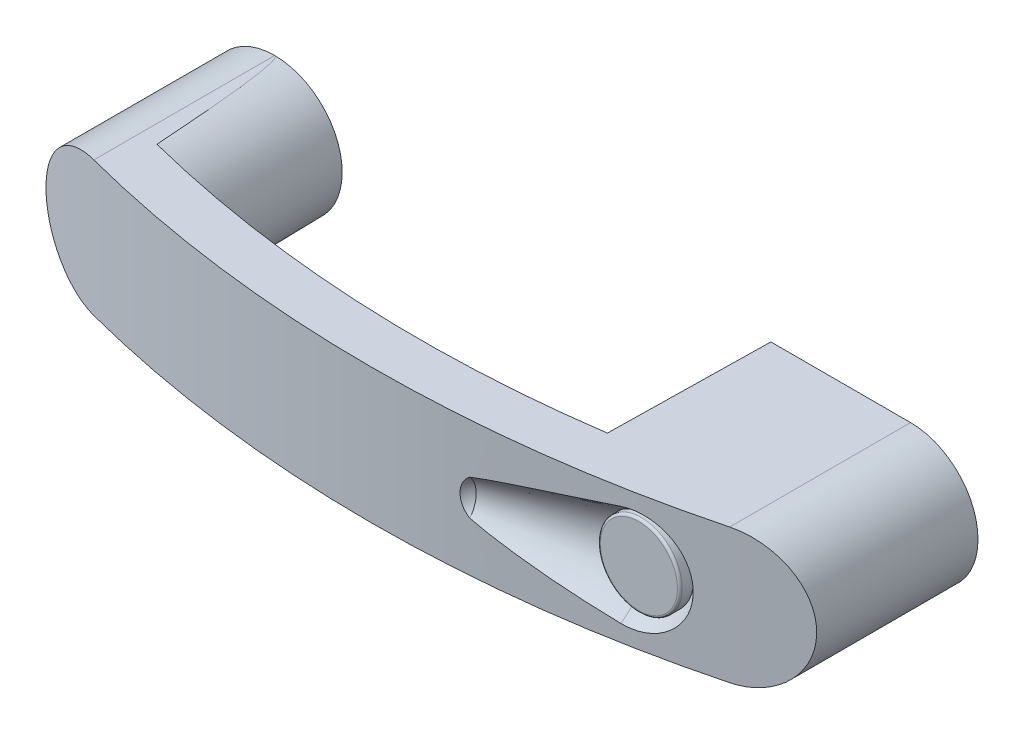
ISO-10303-21;
HEADER;
FILE_DESCRIPTION(('STEP AP214'),'2;1');
FILE_NAME('part.step','',(''),(''),'','','');
FILE_SCHEMA(('AUTOMOTIVE_DESIGN { 1 0 10303 214 1 1 1 1 }'));
ENDSEC;
DATA;
#1=APPLICATION_CONTEXT('core data for automotive mechanical design processes');
#2=APPLICATION_PROTOCOL_DEFINITION('international standard','automotive_design',2000,#1);
#3=PRODUCT_CONTEXT('',#1,'mechanical');
#4=PRODUCT('Part','Part','',(#3));
#5=PRODUCT_RELATED_PRODUCT_CATEGORY('part','',(#4));
#6=PRODUCT_DEFINITION_FORMATION('','',#4);
#7=PRODUCT_DEFINITION_CONTEXT('part definition',#1,'design');
#8=PRODUCT_DEFINITION('design','',#6,#7);
#9=PRODUCT_DEFINITION_SHAPE('','',#8);
#10=(LENGTH_UNIT() NAMED_UNIT(*) SI_UNIT(.MILLI.,.METRE.));
#11=(NAMED_UNIT(*) PLANE_ANGLE_UNIT() SI_UNIT($,.RADIAN.));
#12=(NAMED_UNIT(*) SI_UNIT($,.STERADIAN.) SOLID_ANGLE_UNIT());
#13=UNCERTAINTY_MEASURE_WITH_UNIT(LENGTH_MEASURE(1.E-05),#10,'distance_accuracy_value','');
#14=(GEOMETRIC_REPRESENTATION_CONTEXT(3) GLOBAL_UNCERTAINTY_ASSIGNED_CONTEXT((#13)) GLOBAL_UNIT_ASSIGNED_CONTEXT((#10,
#11,#12)) REPRESENTATION_CONTEXT('',''));
#15=CARTESIAN_POINT('',(0.,0.,0.));
#16=DIRECTION('',(0.,0.,1.));
#17=DIRECTION('',(1.,0.,0.));
#18=AXIS2_PLACEMENT_3D('',#15,#16,#17);
#19=CARTESIAN_POINT('',(132.,0.,0.));
#20=DIRECTION('',(0.,0.,1.));
#21=DIRECTION('',(0.,1.,0.));
#22=AXIS2_PLACEMENT_3D('',#19,#20,#21);
#23=PLANE('',#22);
#24=CARTESIAN_POINT('',(119.8,0.,0.));
#25=DIRECTION('',(0.,0.,1.));
#26=DIRECTION('',(1.,0.,0.));
#27=AXIS2_PLACEMENT_3D('',#24,#25,#26);
#28=CIRCLE('',#27,4.775);
#29=CARTESIAN_POINT('',(124.575,0.,0.));
#30=VERTEX_POINT('',#29);
#31=EDGE_CURVE('E719',#30,#30,#28,.F.);
#32=ORIENTED_EDGE('',*,*,#31,.F.);
#33=EDGE_LOOP('',(#32));
#34=FACE_BOUND('',#33,.T.);
#35=CARTESIAN_POINT('',(113.4,7.1,0.));
#36=DIRECTION('',(0.,0.,1.));
#37=DIRECTION('',(1.,0.,0.));
#38=AXIS2_PLACEMENT_3D('',#35,#36,#37);
#39=CIRCLE('',#38,3.5);
#40=CARTESIAN_POINT('',(116.9,7.1,0.));
#41=VERTEX_POINT('',#40);
#42=EDGE_CURVE('E184',#41,#41,#39,.F.);
#43=ORIENTED_EDGE('',*,*,#42,.F.);
#44=EDGE_LOOP('',(#43));
#45=FACE_BOUND('',#44,.T.);
#46=CARTESIAN_POINT('',(132.,0.,0.));
#47=DIRECTION('',(0.,0.,-1.));
#48=DIRECTION('',(0.,-1.,0.));
#49=AXIS2_PLACEMENT_3D('',#46,#47,#48);
#50=CIRCLE('',#49,3.);
#51=CARTESIAN_POINT('',(132.,-3.,0.));
#52=VERTEX_POINT('',#51);
#53=EDGE_CURVE('E215',#52,#52,#50,.T.);
#54=ORIENTED_EDGE('',*,*,#53,.F.);
#55=EDGE_LOOP('',(#54));
#56=FACE_BOUND('',#55,.T.);
#57=CARTESIAN_POINT('',(132.,0.,0.));
#58=DIRECTION('',(0.,0.,1.));
#59=DIRECTION('',(0.,1.,0.));
#60=AXIS2_PLACEMENT_3D('',#57,#58,#59);
#61=CIRCLE('',#60,14.);
#62=CARTESIAN_POINT('',(132.,-14.,0.));
#63=VERTEX_POINT('',#62);
#64=CARTESIAN_POINT('',(132.,14.,0.));
#65=VERTEX_POINT('',#64);
#66=EDGE_CURVE('E437',#63,#65,#61,.T.);
#67=ORIENTED_EDGE('',*,*,#66,.F.);
#68=DIRECTION('',(-1.,0.,0.));
#69=VECTOR('',#68,1.);
#70=CARTESIAN_POINT('',(132.,-14.,0.));
#71=LINE('',#70,#69);
#72=CARTESIAN_POINT('',(103.,-14.,0.));
#73=VERTEX_POINT('',#72);
#74=EDGE_CURVE('E452',#63,#73,#71,.T.);
#75=ORIENTED_EDGE('',*,*,#74,.T.);
#76=DIRECTION('',(0.,-1.,0.));
#77=VECTOR('',#76,1.);
#78=CARTESIAN_POINT('',(103.,14.,0.));
#79=LINE('',#78,#77);
#80=CARTESIAN_POINT('',(103.,14.,0.));
#81=VERTEX_POINT('',#80);
#82=EDGE_CURVE('E442',#81,#73,#79,.T.);
#83=ORIENTED_EDGE('',*,*,#82,.F.);
#84=DIRECTION('',(-1.,0.,0.));
#85=VECTOR('',#84,1.);
#86=CARTESIAN_POINT('',(132.,14.,0.));
#87=LINE('',#86,#85);
#88=EDGE_CURVE('E400',#65,#81,#87,.T.);
#89=ORIENTED_EDGE('',*,*,#88,.F.);
#90=EDGE_LOOP('',(#67,#75,#83,#89));
#91=FACE_BOUND('',#90,.T.);
#92=CARTESIAN_POINT('',(113.4,-7.1,0.));
#93=DIRECTION('',(0.,0.,1.));
#94=DIRECTION('',(1.,0.,0.));
#95=AXIS2_PLACEMENT_3D('',#92,#93,#94);
#96=CIRCLE('',#95,4.775);
#97=CARTESIAN_POINT('',(118.175,-7.1,0.));
#98=VERTEX_POINT('',#97);
#99=EDGE_CURVE('E118',#98,#98,#96,.F.);
#100=ORIENTED_EDGE('',*,*,#99,.F.);
#101=EDGE_LOOP('',(#100));
#102=FACE_BOUND('',#101,.T.);
#103=ADVANCED_FACE('F14',(#34,#45,#56,#91,#102),#23,.F.);
#104=CARTESIAN_POINT('',(115.,0.,-1.8));
#105=DIRECTION('',(0.,0.,1.));
#106=DIRECTION('',(0.,1.,0.));
#107=AXIS2_PLACEMENT_3D('',#104,#105,#106);
#108=PLANE('',#107);
#109=CARTESIAN_POINT('',(113.4,-7.1,-1.8));
#110=DIRECTION('',(0.,0.,-1.));
#111=DIRECTION('',(0.,-1.,0.));
#112=AXIS2_PLACEMENT_3D('',#109,#110,#111);
#113=CIRCLE('',#112,3.36);
#114=CARTESIAN_POINT('',(113.4,-10.46,-1.8));
#115=VERTEX_POINT('',#114);
#116=EDGE_CURVE('E332',#115,#115,#113,.T.);
#117=ORIENTED_EDGE('',*,*,#116,.F.);
#118=EDGE_LOOP('',(#117));
#119=FACE_BOUND('',#118,.T.);
#120=CARTESIAN_POINT('',(113.4,-7.1,-1.8));
#121=DIRECTION('',(0.,0.,1.));
#122=DIRECTION('',(1.,0.,0.));
#123=AXIS2_PLACEMENT_3D('',#120,#121,#122);
#124=CIRCLE('',#123,4.775);
#125=CARTESIAN_POINT('',(118.175,-7.1,-1.8));
#126=VERTEX_POINT('',#125);
#127=EDGE_CURVE('E722',#126,#126,#124,.T.);
#128=ORIENTED_EDGE('',*,*,#127,.F.);
#129=EDGE_LOOP('',(#128));
#130=FACE_BOUND('',#129,.T.);
#131=ADVANCED_FACE('F287',(#119,#130),#108,.F.);
#132=CARTESIAN_POINT('',(116.44,0.,-3.));
#133=DIRECTION('',(0.,0.,-1.));
#134=DIRECTION('',(0.,-1.,0.));
#135=AXIS2_PLACEMENT_3D('',#132,#133,#134);
#136=PLANE('',#135);
#137=CARTESIAN_POINT('',(113.4,-7.1,-3.));
#138=DIRECTION('',(0.,0.,-1.));
#139=DIRECTION('',(0.,-1.,0.));
#140=AXIS2_PLACEMENT_3D('',#137,#138,#139);
#141=CIRCLE('',#140,3.36);
#142=CARTESIAN_POINT('',(113.4,-10.46,-3.));
#143=VERTEX_POINT('',#142);
#144=EDGE_CURVE('E327',#143,#143,#141,.T.);
#145=ORIENTED_EDGE('',*,*,#144,.T.);
#146=EDGE_LOOP('',(#145));
#147=FACE_BOUND('',#146,.T.);
#148=CARTESIAN_POINT('',(113.4,-7.1,-3.));
#149=DIRECTION('',(0.,0.,-1.));
#150=DIRECTION('',(-1.,0.,0.));
#151=AXIS2_PLACEMENT_3D('',#148,#149,#150);
#152=CIRCLE('',#151,4.775);
#153=CARTESIAN_POINT('',(108.625,-7.1,-3.));
#154=VERTEX_POINT('',#153);
#155=EDGE_CURVE('E117',#154,#154,#152,.T.);
#156=ORIENTED_EDGE('',*,*,#155,.F.);
#157=EDGE_LOOP('',(#156));
#158=FACE_BOUND('',#157,.T.);
#159=ADVANCED_FACE('F140',(#147,#158),#136,.F.);
#160=CARTESIAN_POINT('',(113.4,-7.1,-4.));
#161=DIRECTION('',(0.,0.,1.));
#162=DIRECTION('',(0.,1.,0.));
#163=AXIS2_PLACEMENT_3D('',#160,#161,#162);
#164=CONICAL_SURFACE('',#163,4.8,1.30899693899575);
#165=CARTESIAN_POINT('',(113.4,-7.1,-4.5));
#166=DIRECTION('',(0.,0.,-1.));
#167=DIRECTION('',(0.,-1.,0.));
#168=AXIS2_PLACEMENT_3D('',#165,#166,#167);
#169=CIRCLE('',#168,2.93397459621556);
#170=CARTESIAN_POINT('',(113.4,-10.0339745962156,-4.5));
#171=VERTEX_POINT('',#170);
#172=EDGE_CURVE('E325',#171,#171,#169,.T.);
#173=ORIENTED_EDGE('',*,*,#172,.F.);
#174=EDGE_LOOP('',(#173));
#175=FACE_BOUND('',#174,.T.);
#176=CARTESIAN_POINT('',(113.4,-7.1,-4.00669872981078));
#177=DIRECTION('',(0.,0.,1.));
#178=DIRECTION('',(1.,0.,0.));
#179=AXIS2_PLACEMENT_3D('',#176,#177,#178);
#180=CIRCLE('',#179,4.775);
#181=CARTESIAN_POINT('',(116.384629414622,-3.37272052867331,-4.00669872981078));
#182=VERTEX_POINT('',#181);
#183=CARTESIAN_POINT('',(116.798603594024,-3.74588035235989,-4.00669872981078));
#184=VERTEX_POINT('',#183);
#185=EDGE_CURVE('E111',#182,#184,#180,.T.);
#186=ORIENTED_EDGE('',*,*,#185,.F.);
#187=CARTESIAN_POINT('',(113.4,-7.1,-4.0066987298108));
#188=DIRECTION('',(0.,0.,1.));
#189=DIRECTION('',(0.711749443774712,0.702433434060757,0.));
#190=AXIS2_PLACEMENT_3D('',#187,#188,#189);
#191=CIRCLE('',#190,4.775);
#192=EDGE_CURVE('E115',#184,#182,#191,.T.);
#193=ORIENTED_EDGE('',*,*,#192,.F.);
#194=EDGE_LOOP('',(#186,#193));
#195=FACE_BOUND('',#194,.T.);
#196=ADVANCED_FACE('F121',(#175,#195),#164,.T.);
#197=CARTESIAN_POINT('',(119.8,0.,-4.));
#198=DIRECTION('',(0.,0.,1.));
#199=DIRECTION('',(0.,1.,0.));
#200=AXIS2_PLACEMENT_3D('',#197,#198,#199);
#201=CONICAL_SURFACE('',#200,4.8,1.30899693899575);
#202=CARTESIAN_POINT('',(119.8,0.,-4.5));
#203=DIRECTION('',(0.,0.,-1.));
#204=DIRECTION('',(0.,-1.,0.));
#205=AXIS2_PLACEMENT_3D('',#202,#203,#204);
#206=CIRCLE('',#205,2.93397459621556);
#207=CARTESIAN_POINT('',(119.8,-2.93397459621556,-4.5));
#208=VERTEX_POINT('',#207);
#209=EDGE_CURVE('E335',#208,#208,#206,.T.);
#210=ORIENTED_EDGE('',*,*,#209,.F.);
#211=EDGE_LOOP('',(#210));
#212=FACE_BOUND('',#211,.T.);
#213=CARTESIAN_POINT('',(119.8,0.,-4.00669872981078));
#214=DIRECTION('',(0.,0.,1.));
#215=DIRECTION('',(1.,0.,0.));
#216=AXIS2_PLACEMENT_3D('',#213,#214,#215);
#217=CIRCLE('',#216,4.775);
#218=CARTESIAN_POINT('',(116.815370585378,-3.72727947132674,-4.00669872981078));
#219=VERTEX_POINT('',#218);
#220=CARTESIAN_POINT('',(116.815370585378,3.7272794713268,-4.00669872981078));
#221=VERTEX_POINT('',#220);
#222=EDGE_CURVE('E179',#219,#221,#217,.T.);
#223=ORIENTED_EDGE('',*,*,#222,.F.);
#224=CARTESIAN_POINT('',(116.815370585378,-3.7272794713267,-4.00669872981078));
#225=CARTESIAN_POINT('',(116.798973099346,-3.7106740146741,-4.00742561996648));
#226=CARTESIAN_POINT('',(116.78245650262,-3.69418209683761,-4.00806350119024));
#227=CARTESIAN_POINT('',(116.749251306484,-3.66150010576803,-4.00915641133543));
#228=CARTESIAN_POINT('',(116.732563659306,-3.64530908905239,-4.00961216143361));
#229=CARTESIAN_POINT('',(116.698996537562,-3.613213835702,-4.01034084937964));
#230=CARTESIAN_POINT('',(116.682117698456,-3.59730894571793,-4.01061427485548));
#231=CARTESIAN_POINT('',(116.64814941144,-3.56576984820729,-4.01097860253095));
#232=CARTESIAN_POINT('',(116.63106027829,-3.55013530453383,-4.01106975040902));
#233=CARTESIAN_POINT('',(116.596652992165,-3.51912028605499,-4.01106975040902));
#234=CARTESIAN_POINT('',(116.57933483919,-3.50373981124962,-4.01097860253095));
#235=CARTESIAN_POINT('',(116.54445168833,-3.47321564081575,-4.01061427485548));
#236=CARTESIAN_POINT('',(116.526886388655,-3.45807229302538,-4.01034084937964));
#237=CARTESIAN_POINT('',(116.491491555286,-3.42800465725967,-4.00961216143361));
#238=CARTESIAN_POINT('',(116.473661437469,-3.41308106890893,-4.00915641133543));
#239=CARTESIAN_POINT('',(116.437720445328,-3.38343410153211,-4.00806350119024));
#240=CARTESIAN_POINT('',(116.419608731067,-3.36871176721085,-4.00742561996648));
#241=CARTESIAN_POINT('',(116.401396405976,-3.35411964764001,-4.00669872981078));
#242=B_SPLINE_CURVE_WITH_KNOTS('',3,(#224,#225,#226,#227,#228,#229,#230,#231,#232,#233,#234,
#235,#236,#237,#238,#239,#240,#241),.UNSPECIFIED.,.F.,.F.,(4,2,2,2,2,2,2,2,4),(0.,
0.0700446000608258,0.139809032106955,0.209386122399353,0.27886937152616,0.348352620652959,
0.41792971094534,0.487694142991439,0.557738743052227),.UNSPECIFIED.);
#243=CARTESIAN_POINT('',(116.401396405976,-3.35411964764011,-4.00669872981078));
#244=VERTEX_POINT('',#243);
#245=EDGE_CURVE('E9',#219,#244,#242,.T.);
#246=ORIENTED_EDGE('',*,*,#245,.T.);
#247=CARTESIAN_POINT('',(116.401396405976,3.35411964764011,-4.00669872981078));
#248=VERTEX_POINT('',#247);
#249=EDGE_CURVE('E181',#248,#244,#217,.T.);
#250=ORIENTED_EDGE('',*,*,#249,.F.);
#251=CARTESIAN_POINT('',(116.401396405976,3.35411964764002,-4.00669872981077));
#252=CARTESIAN_POINT('',(116.419608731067,3.36871176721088,-4.00742561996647));
#253=CARTESIAN_POINT('',(116.437720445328,3.38343410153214,-4.00806350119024));
#254=CARTESIAN_POINT('',(116.473661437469,3.41308106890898,-4.00915641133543));
#255=CARTESIAN_POINT('',(116.491491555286,3.42800465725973,-4.00961216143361));
#256=CARTESIAN_POINT('',(116.526886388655,3.45807229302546,-4.01034084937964));
#257=CARTESIAN_POINT('',(116.54445168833,3.47321564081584,-4.01061427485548));
#258=CARTESIAN_POINT('',(116.57933483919,3.50373981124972,-4.01097860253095));
#259=CARTESIAN_POINT('',(116.596652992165,3.5191202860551,-4.01106975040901));
#260=CARTESIAN_POINT('',(116.63106027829,3.55013530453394,-4.01106975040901));
#261=CARTESIAN_POINT('',(116.64814941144,3.5657698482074,-4.01097860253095));
#262=CARTESIAN_POINT('',(116.682117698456,3.59730894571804,-4.01061427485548));
#263=CARTESIAN_POINT('',(116.698996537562,3.61321383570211,-4.01034084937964));
#264=CARTESIAN_POINT('',(116.732563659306,3.6453090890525,-4.00961216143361));
#265=CARTESIAN_POINT('',(116.749251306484,3.66150010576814,-4.00915641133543));
#266=CARTESIAN_POINT('',(116.78245650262,3.69418209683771,-4.00806350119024));
#267=CARTESIAN_POINT('',(116.798973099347,3.7106740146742,-4.00742561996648));
#268=CARTESIAN_POINT('',(116.815370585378,3.72727947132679,-4.00669872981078));
#269=B_SPLINE_CURVE_WITH_KNOTS('',3,(#251,#252,#253,#254,#255,#256,#257,#258,#259,#260,#261,
#262,#263,#264,#265,#266,#267,#268),.UNSPECIFIED.,.F.,.F.,(4,2,2,2,2,2,2,2,4),(0.,
0.0700446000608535,0.139809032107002,0.209386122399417,0.278869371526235,0.348352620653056,
0.417929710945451,0.487694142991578,0.557738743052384),.UNSPECIFIED.);
#270=EDGE_CURVE('E122',#248,#221,#269,.T.);
#271=ORIENTED_EDGE('',*,*,#270,.T.);
#272=EDGE_LOOP('',(#223,#246,#250,#271));
#273=FACE_BOUND('',#272,.T.);
#274=ADVANCED_FACE('F139',(#212,#273),#201,.T.);
#275=CARTESIAN_POINT('',(119.8,0.,-1.8));
#276=DIRECTION('',(0.,0.,-1.));
#277=DIRECTION('',(0.,-1.,0.));
#278=AXIS2_PLACEMENT_3D('',#275,#276,#277);
#279=CIRCLE('',#278,3.36);
#280=CARTESIAN_POINT('',(119.8,-3.36,-1.8));
#281=VERTEX_POINT('',#280);
#282=EDGE_CURVE('E341',#281,#281,#279,.T.);
#283=ORIENTED_EDGE('',*,*,#282,.F.);
#284=EDGE_LOOP('',(#283));
#285=FACE_BOUND('',#284,.T.);
#286=CARTESIAN_POINT('',(119.8,0.,-1.8));
#287=DIRECTION('',(0.,0.,1.));
#288=DIRECTION('',(1.,0.,0.));
#289=AXIS2_PLACEMENT_3D('',#286,#287,#288);
#290=CIRCLE('',#289,4.775);
#291=CARTESIAN_POINT('',(124.575,0.,-1.8));
#292=VERTEX_POINT('',#291);
#293=EDGE_CURVE('E202',#292,#292,#290,.T.);
#294=ORIENTED_EDGE('',*,*,#293,.F.);
#295=EDGE_LOOP('',(#294));
#296=FACE_BOUND('',#295,.T.);
#297=ADVANCED_FACE('F156',(#285,#296),#108,.F.);
#298=CARTESIAN_POINT('',(119.8,0.,-3.));
#299=DIRECTION('',(0.,0.,-1.));
#300=DIRECTION('',(0.,-1.,0.));
#301=AXIS2_PLACEMENT_3D('',#298,#299,#300);
#302=CIRCLE('',#301,3.36);
#303=CARTESIAN_POINT('',(119.8,-3.36,-3.));
#304=VERTEX_POINT('',#303);
#305=EDGE_CURVE('E338',#304,#304,#302,.T.);
#306=ORIENTED_EDGE('',*,*,#305,.T.);
#307=EDGE_LOOP('',(#306));
#308=FACE_BOUND('',#307,.T.);
#309=CARTESIAN_POINT('',(119.8,0.,-3.));
#310=DIRECTION('',(0.,0.,-1.));
#311=DIRECTION('',(-1.,0.,0.));
#312=AXIS2_PLACEMENT_3D('',#309,#310,#311);
#313=CIRCLE('',#312,4.775);
#314=CARTESIAN_POINT('',(115.025,0.,-3.));
#315=VERTEX_POINT('',#314);
#316=EDGE_CURVE('E206',#315,#315,#313,.T.);
#317=ORIENTED_EDGE('',*,*,#316,.F.);
#318=EDGE_LOOP('',(#317));
#319=FACE_BOUND('',#318,.T.);
#320=ADVANCED_FACE('F755',(#308,#319),#136,.F.);
#321=CARTESIAN_POINT('',(116.558141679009,0.,46.5412868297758));
#322=DIRECTION('',(-0.996194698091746,0.,0.0871557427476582));
#323=DIRECTION('',(0.0871557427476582,0.,0.996194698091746));
#324=AXIS2_PLACEMENT_3D('',#321,#322,#323);
#325=SPHERICAL_SURFACE('',#324,12.);
#326=CARTESIAN_POINT('',(112.913459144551,-8.06427295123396,38.4367331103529));
#327=CARTESIAN_POINT('',(113.141691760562,-8.14033289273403,38.4097493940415));
#328=CARTESIAN_POINT('',(113.373137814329,-8.20664681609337,38.3825233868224));
#329=CARTESIAN_POINT('',(113.840772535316,-8.31942619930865,38.3277900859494));
#330=CARTESIAN_POINT('',(114.076960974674,-8.3658926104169,38.3002828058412));
#331=CARTESIAN_POINT('',(114.55227365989,-8.43860575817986,38.2452044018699));
#332=CARTESIAN_POINT('',(114.791396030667,-8.46486478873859,38.2176333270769));
#333=CARTESIAN_POINT('',(115.271016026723,-8.49703055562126,38.1626058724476));
#334=CARTESIAN_POINT('',(115.511513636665,-8.50293751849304,38.135149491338));
#335=CARTESIAN_POINT('',(115.992291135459,-8.49434763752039,38.0805272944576));
#336=CARTESIAN_POINT('',(116.232570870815,-8.47984129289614,38.053361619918));
#337=CARTESIAN_POINT('',(116.711092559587,-8.43049985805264,37.9995154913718));
#338=CARTESIAN_POINT('',(116.949334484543,-8.39566448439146,37.9728350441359));
#339=CARTESIAN_POINT('',(117.422025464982,-8.30590658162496,37.9201398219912));
#340=CARTESIAN_POINT('',(117.656475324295,-8.25098836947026,37.8941249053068));
#341=CARTESIAN_POINT('',(118.119954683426,-8.12143626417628,37.8429210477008));
#342=CARTESIAN_POINT('',(118.348984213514,-8.04680248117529,37.8177321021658));
#343=CARTESIAN_POINT('',(118.799679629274,-7.87844158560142,37.7683702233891));
#344=CARTESIAN_POINT('',(119.021354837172,-7.78473980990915,37.7441959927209));
#345=CARTESIAN_POINT('',(119.456137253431,-7.57879197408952,37.6969680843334));
#346=CARTESIAN_POINT('',(119.669241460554,-7.46653948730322,37.673914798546));
#347=CARTESIAN_POINT('',(120.085247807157,-7.22429824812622,37.6290776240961));
#348=CARTESIAN_POINT('',(120.288150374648,-7.09431024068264,37.607293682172));
#349=CARTESIAN_POINT('',(120.682288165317,-6.81750239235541,37.5651232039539));
#350=CARTESIAN_POINT('',(120.873523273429,-6.67068238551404,37.5447366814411));
#351=CARTESIAN_POINT('',(121.242076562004,-6.36195669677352,37.5055708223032));
#352=CARTESIAN_POINT('',(121.419454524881,-6.20012326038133,37.4867845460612));
#353=CARTESIAN_POINT('',(121.75997133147,-5.86193942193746,37.4508226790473));
#354=CARTESIAN_POINT('',(121.923109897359,-5.68558873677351,37.4336471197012));
#355=CARTESIAN_POINT('',(122.23390643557,-5.31967035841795,37.4010091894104));
#356=CARTESIAN_POINT('',(122.381568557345,-5.13010623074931,37.3855463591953));
#357=CARTESIAN_POINT('',(122.660424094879,-4.73899906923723,37.3564106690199));
#358=CARTESIAN_POINT('',(122.791611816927,-4.53745192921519,37.3427384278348));
#359=CARTESIAN_POINT('',(123.035791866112,-4.12505713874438,37.3173392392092));
#360=CARTESIAN_POINT('',(123.148883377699,-3.91426886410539,37.3056016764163));
#361=CARTESIAN_POINT('',(123.35693707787,-3.48382955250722,37.2840426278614));
#362=CARTESIAN_POINT('',(123.451899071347,-3.26417842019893,37.2742211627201));
#363=CARTESIAN_POINT('',(123.622990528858,-2.81758778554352,37.2565484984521));
#364=CARTESIAN_POINT('',(123.699120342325,-2.59064841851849,37.2486972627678));
#365=CARTESIAN_POINT('',(123.83198848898,-2.13109748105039,37.2350075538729));
#366=CARTESIAN_POINT('',(123.888726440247,-1.89848579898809,37.2291691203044));
#367=CARTESIAN_POINT('',(123.98217070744,-1.43035627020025,37.2195594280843));
#368=CARTESIAN_POINT('',(124.01896886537,-1.19485694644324,37.21577869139));
#369=CARTESIAN_POINT('',(124.072673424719,-0.721499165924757,37.2102624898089));
#370=CARTESIAN_POINT('',(124.089573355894,-0.483639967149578,37.2085276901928));
#371=CARTESIAN_POINT('',(124.103333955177,-0.00738052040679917,37.2071150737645));
#372=CARTESIAN_POINT('',(124.100198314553,0.23101961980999,37.2074368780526));
#373=CARTESIAN_POINT('',(124.073919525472,0.706702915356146,37.2101348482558));
#374=CARTESIAN_POINT('',(124.050776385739,0.943986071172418,37.2125110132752));
#375=CARTESIAN_POINT('',(123.984711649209,1.41532374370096,37.2192988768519));
#376=CARTESIAN_POINT('',(123.941825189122,1.64938323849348,37.2237069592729));
#377=CARTESIAN_POINT('',(123.836616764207,2.11296475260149,37.2345320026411));
#378=CARTESIAN_POINT('',(123.774301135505,2.34248822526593,37.2409483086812));
#379=CARTESIAN_POINT('',(123.63067264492,2.79549044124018,37.2557570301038));
#380=CARTESIAN_POINT('',(123.54935647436,3.01896812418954,37.2641497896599));
#381=CARTESIAN_POINT('',(123.368327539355,3.45825421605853,37.2828653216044));
#382=CARTESIAN_POINT('',(123.268615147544,3.67406278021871,37.2931880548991));
#383=CARTESIAN_POINT('',(123.05138803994,4.09674822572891,37.3157211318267));
#384=CARTESIAN_POINT('',(122.933852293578,4.3036141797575,37.3279337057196));
#385=CARTESIAN_POINT('',(122.681920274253,4.70668555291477,37.3541707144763));
#386=CARTESIAN_POINT('',(122.547524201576,4.90289109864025,37.368195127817));
#387=CARTESIAN_POINT('',(122.262813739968,5.2833104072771,37.3979818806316));
#388=CARTESIAN_POINT('',(122.112496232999,5.46752180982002,37.4137445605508));
#389=CARTESIAN_POINT('',(121.797100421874,5.82256910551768,37.4469127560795));
#390=CARTESIAN_POINT('',(121.632027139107,5.9934095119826,37.4643177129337));
#391=CARTESIAN_POINT('',(121.28754594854,6.32128121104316,37.500753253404));
#392=CARTESIAN_POINT('',(121.108081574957,6.47825246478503,37.5197902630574));
#393=CARTESIAN_POINT('',(120.736709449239,6.77649853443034,37.5593190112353));
#394=CARTESIAN_POINT('',(120.544801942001,6.91777365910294,37.5798107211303));
#395=CARTESIAN_POINT('',(120.149918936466,7.18365447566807,37.6221306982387));
#396=CARTESIAN_POINT('',(119.946943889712,7.30826084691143,37.6439589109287));
#397=CARTESIAN_POINT('',(119.531363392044,7.53995886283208,37.6888253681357));
#398=CARTESIAN_POINT('',(119.31875803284,7.64705067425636,37.7118636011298));
#399=CARTESIAN_POINT('',(118.884244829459,7.8435255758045,37.7591418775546));
#400=CARTESIAN_POINT('',(118.662292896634,7.93280976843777,37.783387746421));
#401=CARTESIAN_POINT('',(118.211826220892,8.09230714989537,37.8328096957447));
#402=CARTESIAN_POINT('',(117.983313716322,8.16252675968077,37.8579854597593));
#403=CARTESIAN_POINT('',(117.521122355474,8.28350103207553,37.9091356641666));
#404=CARTESIAN_POINT('',(117.287440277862,8.33424317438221,37.9351106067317));
#405=CARTESIAN_POINT('',(116.816709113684,8.41585880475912,37.9876785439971));
#406=CARTESIAN_POINT('',(116.579660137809,8.44673294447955,38.0142715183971));
#407=CARTESIAN_POINT('',(116.10247672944,8.48853416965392,38.0680595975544));
#408=CARTESIAN_POINT('',(115.862332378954,8.49934472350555,38.0952572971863));
#409=CARTESIAN_POINT('',(115.382024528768,8.50059740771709,38.1499217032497));
#410=CARTESIAN_POINT('',(115.141861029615,8.49103999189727,38.1773884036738));
#411=CARTESIAN_POINT('',(114.663613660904,8.45166638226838,38.2323556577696));
#412=CARTESIAN_POINT('',(114.425527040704,8.42188321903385,38.2598560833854));
#413=CARTESIAN_POINT('',(113.952809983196,8.34231130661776,38.314730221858));
#414=CARTESIAN_POINT('',(113.718177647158,8.29253400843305,38.3421039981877));
#415=CARTESIAN_POINT('',(113.389661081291,8.2081867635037,38.3806215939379));
#416=CARTESIAN_POINT('',(113.293651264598,8.18172819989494,38.3919019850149));
#417=CARTESIAN_POINT('',(113.102736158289,8.12548818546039,38.4143793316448));
#418=CARTESIAN_POINT('',(113.007829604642,8.09571106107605,38.4255763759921));
#419=CARTESIAN_POINT('',(112.913459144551,8.06427295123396,38.4367331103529));
#420=B_SPLINE_CURVE_WITH_KNOTS('',3,(#326,#327,#328,#329,#330,#331,#332,#333,#334,#335,#336,
#337,#338,#339,#340,#341,#342,#343,#344,#345,#346,#347,#348,#349,#350,#351,#352,#353,#354,#355,
#356,#357,#358,#359,#360,#361,#362,#363,#364,#365,#366,#367,#368,#369,#370,#371,#372,#373,#374,
#375,#376,#377,#378,#379,#380,#381,#382,#383,#384,#385,#386,#387,#388,#389,#390,#391,#392,#393,
#394,#395,#396,#397,#398,#399,#400,#401,#402,#403,#404,#405,#406,#407,#408,#409,#410,#411,#412,
#413,#414,#415,#416,#417,#418,#419),.UNSPECIFIED.,.F.,.F.,(4,2,2,2,2,2,2,2,2,2,2,2,2,2,2,2,2,2,
2,2,2,2,2,2,2,2,2,2,2,2,2,2,2,2,2,2,2,2,2,2,2,2,2,2,2,2,4),(0.,0.726021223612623,
1.45200764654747,2.17755203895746,2.90308835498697,3.62896246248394,4.35484669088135,
5.08057497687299,5.80629920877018,6.53106534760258,7.25608310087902,7.98107041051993,
8.70606486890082,9.42773561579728,10.149420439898,10.870911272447,11.5926507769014,
12.3102879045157,13.0279327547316,13.7455642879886,14.4632099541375,15.1775214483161,
15.8920651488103,16.6064772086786,17.3208889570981,18.0340341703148,18.7469470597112,
19.4599841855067,20.1730068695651,20.8868775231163,21.6007396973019,22.3147419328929,
23.0285021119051,23.7452144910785,24.4619127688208,25.17858182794,25.895244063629,
26.6157818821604,27.3360767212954,28.0568338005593,28.7775672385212,29.5024738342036,
30.2273642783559,30.9510737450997,31.6743693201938,31.9749970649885,32.2752373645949),.UNSPECIFIED.);
#421=CARTESIAN_POINT('',(113.201899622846,-8.15469892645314,38.4027043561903));
#422=VERTEX_POINT('',#421);
#423=CARTESIAN_POINT('',(113.201899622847,8.15469892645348,38.4027043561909));
#424=VERTEX_POINT('',#423);
#425=EDGE_CURVE('E32',#422,#424,#420,.T.);
#426=ORIENTED_EDGE('',*,*,#425,.F.);
#427=CARTESIAN_POINT('',(113.934019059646,0.,46.770867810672));
#428=DIRECTION('',(-0.996194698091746,0.,0.0871557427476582));
#429=DIRECTION('',(0.0871557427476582,0.,0.996194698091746));
#430=AXIS2_PLACEMENT_3D('',#427,#428,#429);
#431=CIRCLE('',#430,11.7073170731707);
#432=CARTESIAN_POINT('',(113.486929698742,-10.5236248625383,41.6606130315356));
#433=VERTEX_POINT('',#432);
#434=EDGE_CURVE('E323',#422,#433,#431,.T.);
#435=ORIENTED_EDGE('',*,*,#434,.T.);
#436=CARTESIAN_POINT('',(112.913459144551,10.387951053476,41.7656442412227));
#437=CARTESIAN_POINT('',(113.195016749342,10.4632138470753,41.7144055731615));
#438=CARTESIAN_POINT('',(113.479619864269,10.5263593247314,41.6621263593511));
#439=CARTESIAN_POINT('',(114.052851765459,10.6280835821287,41.5558341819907));
#440=CARTESIAN_POINT('',(114.34148038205,10.6666633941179,41.5018212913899));
#441=CARTESIAN_POINT('',(114.92048282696,10.7189090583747,41.3924499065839));
#442=CARTESIAN_POINT('',(115.210855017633,10.7325954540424,41.3370925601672));
#443=CARTESIAN_POINT('',(115.791505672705,10.7350241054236,41.2253745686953));
#444=CARTESIAN_POINT('',(116.081784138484,10.723766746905,41.1690139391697));
#445=CARTESIAN_POINT('',(116.660330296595,10.6763791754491,41.055670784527));
#446=CARTESIAN_POINT('',(116.948596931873,10.6402367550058,40.9986879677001));
#447=CARTESIAN_POINT('',(117.520935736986,10.5433387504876,40.8845622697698));
#448=CARTESIAN_POINT('',(117.805007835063,10.4825827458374,40.8274193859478));
#449=CARTESIAN_POINT('',(118.36689395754,10.3369283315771,40.7134406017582));
#450=CARTESIAN_POINT('',(118.644709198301,10.2520346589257,40.6566046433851));
#451=CARTESIAN_POINT('',(119.192193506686,10.0587352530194,40.5436974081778));
#452=CARTESIAN_POINT('',(119.461862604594,9.95032960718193,40.4876261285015));
#453=CARTESIAN_POINT('',(119.991387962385,9.71071928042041,40.3766823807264));
#454=CARTESIAN_POINT('',(120.251236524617,9.5794971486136,40.3218108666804));
#455=CARTESIAN_POINT('',(120.75922104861,9.29522002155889,40.2137685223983));
#456=CARTESIAN_POINT('',(121.007352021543,9.14215583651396,40.1605984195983));
#457=CARTESIAN_POINT('',(121.490136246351,8.81532908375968,40.0564503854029));
#458=CARTESIAN_POINT('',(121.724787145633,8.64156291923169,40.0054728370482));
#459=CARTESIAN_POINT('',(122.178890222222,8.2746914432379,39.9062060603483));
#460=CARTESIAN_POINT('',(122.398348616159,8.08159412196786,39.8579157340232));
#461=CARTESIAN_POINT('',(122.822337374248,7.67583398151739,39.7640895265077));
#462=CARTESIAN_POINT('',(123.026740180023,7.46303231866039,39.7185776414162));
#463=CARTESIAN_POINT('',(123.417376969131,7.02067539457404,39.6311500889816));
#464=CARTESIAN_POINT('',(123.603610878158,6.7911200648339,39.5892344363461));
#465=CARTESIAN_POINT('',(123.956677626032,6.31690466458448,39.5094054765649));
#466=CARTESIAN_POINT('',(124.123511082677,6.07224507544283,39.4714920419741));
#467=CARTESIAN_POINT('',(124.436700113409,5.56954377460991,39.4000350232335));
#468=CARTESIAN_POINT('',(124.583055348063,5.31150184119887,39.3664915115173));
#469=CARTESIAN_POINT('',(124.855709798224,4.78119021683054,39.3037900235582));
#470=CARTESIAN_POINT('',(124.981792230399,4.50880342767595,39.2746796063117));
#471=CARTESIAN_POINT('',(125.211280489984,3.95415999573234,39.2215471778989));
#472=CARTESIAN_POINT('',(125.314686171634,3.67190328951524,39.1975251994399));
#473=CARTESIAN_POINT('',(125.498159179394,3.09949381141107,39.1548117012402));
#474=CARTESIAN_POINT('',(125.578225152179,2.80934058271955,39.1361204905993));
#475=CARTESIAN_POINT('',(125.714498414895,2.22318658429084,39.104260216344));
#476=CARTESIAN_POINT('',(125.770705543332,1.92718577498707,39.091091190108));
#477=CARTESIAN_POINT('',(125.859264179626,1.32895864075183,39.0703247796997));
#478=CARTESIAN_POINT('',(125.891416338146,1.02670117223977,39.062773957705));
#479=CARTESIAN_POINT('',(125.930896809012,0.420479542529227,39.0535003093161));
#480=CARTESIAN_POINT('',(125.9382249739,0.116515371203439,39.0517775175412));
#481=CARTESIAN_POINT('',(125.928009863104,-0.490982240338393,39.05417789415));
#482=CARTESIAN_POINT('',(125.910465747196,-0.794515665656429,39.0583012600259));
#483=CARTESIAN_POINT('',(125.850618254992,-1.39898989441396,39.0723513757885));
#484=CARTESIAN_POINT('',(125.808315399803,-1.69993075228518,39.0822780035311));
#485=CARTESIAN_POINT('',(125.699054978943,-2.29802063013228,39.1078712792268));
#486=CARTESIAN_POINT('',(125.632021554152,-2.59515504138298,39.1235555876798));
#487=CARTESIAN_POINT('',(125.473754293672,-3.18255464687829,39.1604968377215));
#488=CARTESIAN_POINT('',(125.382520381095,-3.47281981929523,39.1817537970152));
#489=CARTESIAN_POINT('',(125.176453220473,-4.04438916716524,39.2296192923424));
#490=CARTESIAN_POINT('',(125.061620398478,-4.32569350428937,39.2562277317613));
#491=CARTESIAN_POINT('',(124.809114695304,-4.87731112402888,39.314521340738));
#492=CARTESIAN_POINT('',(124.671441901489,-5.14762444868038,39.3462064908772));
#493=CARTESIAN_POINT('',(124.374664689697,-5.6744230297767,39.4142157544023));
#494=CARTESIAN_POINT('',(124.21563215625,-5.93095079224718,39.4505242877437));
#495=CARTESIAN_POINT('',(123.876857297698,-6.4292568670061,39.5274927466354));
#496=CARTESIAN_POINT('',(123.69711498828,-6.67103519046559,39.5681526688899));
#497=CARTESIAN_POINT('',(123.318136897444,-7.13806335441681,39.6534155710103));
#498=CARTESIAN_POINT('',(123.118900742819,-7.36331287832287,39.6980186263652));
#499=CARTESIAN_POINT('',(122.702307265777,-7.79559918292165,39.7907228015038));
#500=CARTESIAN_POINT('',(122.484950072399,-8.00263609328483,39.8388238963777));
#501=CARTESIAN_POINT('',(122.035526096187,-8.39528040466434,39.9376335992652));
#502=CARTESIAN_POINT('',(121.803598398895,-8.58105338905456,39.9883168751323));
#503=CARTESIAN_POINT('',(121.325015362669,-8.93177435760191,40.0921760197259));
#504=CARTESIAN_POINT('',(121.078359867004,-9.09672212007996,40.1453519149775));
#505=CARTESIAN_POINT('',(120.572086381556,-9.40452440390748,40.2536914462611));
#506=CARTESIAN_POINT('',(120.312470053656,-9.54738174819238,40.3088548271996));
#507=CARTESIAN_POINT('',(119.78208955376,-9.8099387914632,40.4206705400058));
#508=CARTESIAN_POINT('',(119.511325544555,-9.92963882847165,40.4773228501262));
#509=CARTESIAN_POINT('',(118.963344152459,-10.1438869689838,40.5910397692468));
#510=CARTESIAN_POINT('',(118.686218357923,-10.2386745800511,40.6480945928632));
#511=CARTESIAN_POINT('',(118.124912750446,-10.403933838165,40.7626832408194));
#512=CARTESIAN_POINT('',(117.840733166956,-10.4744062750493,40.8202170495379));
#513=CARTESIAN_POINT('',(117.267366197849,-10.5904983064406,40.9352888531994));
#514=CARTESIAN_POINT('',(116.978179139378,-10.6361195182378,40.9928268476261));
#515=CARTESIAN_POINT('',(116.396875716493,-10.702162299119,41.1074534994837));
#516=CARTESIAN_POINT('',(116.104759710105,-10.7225869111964,41.1645422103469));
#517=CARTESIAN_POINT('',(115.568500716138,-10.7368008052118,41.2683918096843));
#518=CARTESIAN_POINT('',(115.324478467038,-10.7344627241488,41.3152878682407));
#519=CARTESIAN_POINT('',(114.837096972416,-10.712209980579,41.4082351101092));
#520=CARTESIAN_POINT('',(114.593737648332,-10.6922975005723,41.4542863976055));
#521=CARTESIAN_POINT('',(114.109016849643,-10.6350135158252,41.5453031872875));
#522=CARTESIAN_POINT('',(113.867654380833,-10.5976513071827,41.5902692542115));
#523=CARTESIAN_POINT('',(113.387967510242,-10.5056822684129,41.6789482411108));
#524=CARTESIAN_POINT('',(113.149643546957,-10.45107297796,41.7226609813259));
#525=CARTESIAN_POINT('',(112.913459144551,-10.387951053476,41.7656442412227));
#526=B_SPLINE_CURVE_WITH_KNOTS('',3,(#436,#437,#438,#439,#440,#441,#442,#443,#444,#445,#446,
#447,#448,#449,#450,#451,#452,#453,#454,#455,#456,#457,#458,#459,#460,#461,#462,#463,#464,#465,
#466,#467,#468,#469,#470,#471,#472,#473,#474,#475,#476,#477,#478,#479,#480,#481,#482,#483,#484,
#485,#486,#487,#488,#489,#490,#491,#492,#493,#494,#495,#496,#497,#498,#499,#500,#501,#502,#503,
#504,#505,#506,#507,#508,#509,#510,#511,#512,#513,#514,#515,#516,#517,#518,#519,#520,#521,#522,
#523,#524,#525),.UNSPECIFIED.,.F.,.F.,(4,2,2,2,2,2,2,2,2,2,2,2,2,2,2,2,2,2,2,2,2,2,2,2,2,2,2,2,
2,2,2,2,2,2,2,2,2,2,2,2,2,2,2,2,4),(0.,0.887471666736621,1.77490603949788,2.66160772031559,
3.54829568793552,4.43541893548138,5.32255734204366,6.20952176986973,7.09648290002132,
7.98412541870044,8.87214251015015,9.7603141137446,10.6481201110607,11.5427428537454,
12.4373692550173,13.3319671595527,14.2265798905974,15.1302005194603,16.033826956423,
16.9375057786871,17.8411907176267,18.7522841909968,19.6633830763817,20.5745127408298,
21.4856232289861,22.3995520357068,23.3134837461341,24.2273989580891,25.1413106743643,
26.0522203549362,26.9631293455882,27.8740557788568,28.7849757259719,29.6882346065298,
30.5915031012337,31.4946560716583,32.3977958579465,33.2919059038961,34.1859869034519,
35.0800097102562,35.973924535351,36.718819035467,37.4636210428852,38.2080267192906,
38.9525386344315),.UNSPECIFIED.);
#527=CARTESIAN_POINT('',(113.486929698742,10.5236248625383,41.6606130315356));
#528=VERTEX_POINT('',#527);
#529=EDGE_CURVE('E310',#528,#433,#526,.T.);
#530=ORIENTED_EDGE('',*,*,#529,.F.);
#531=EDGE_CURVE('E322',#528,#424,#431,.T.);
#532=ORIENTED_EDGE('',*,*,#531,.T.);
#533=EDGE_LOOP('',(#426,#435,#530,#532));
#534=FACE_BOUND('',#533,.T.);
#535=ADVANCED_FACE('F235',(#534),#325,.F.);
#536=CARTESIAN_POINT('',(113.934019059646,0.,46.770867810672));
#537=DIRECTION('',(0.996194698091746,0.,-0.0871557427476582));
#538=DIRECTION('',(-0.0871557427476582,0.,-0.996194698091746));
#539=AXIS2_PLACEMENT_3D('',#536,#537,#538);
#540=CONICAL_SURFACE('',#539,11.7073170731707,0.221314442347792);
#541=ORIENTED_EDGE('',*,*,#434,.F.);
#542=CARTESIAN_POINT('',(113.487129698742,-8.23321195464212,38.3638811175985));
#543=CARTESIAN_POINT('',(113.391516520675,-8.20867682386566,38.3786560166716));
#544=CARTESIAN_POINT('',(113.296086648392,-8.18240913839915,38.3916283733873));
#545=CARTESIAN_POINT('',(113.105827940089,-8.1264343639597,38.4140021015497));
#546=CARTESIAN_POINT('',(113.010999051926,-8.09672757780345,38.4234037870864));
#547=CARTESIAN_POINT('',(112.728065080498,-8.00258827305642,38.446281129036));
#548=CARTESIAN_POINT('',(112.541182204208,-7.93305221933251,38.4544796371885));
#549=CARTESIAN_POINT('',(112.174745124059,-7.78180716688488,38.4577324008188));
#550=CARTESIAN_POINT('',(111.995133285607,-7.70023892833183,38.4529287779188));
#551=CARTESIAN_POINT('',(111.642505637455,-7.52509177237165,38.4320295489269));
#552=CARTESIAN_POINT('',(111.469491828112,-7.43150924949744,38.4159305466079));
#553=CARTESIAN_POINT('',(111.132144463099,-7.23369250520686,38.3744198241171));
#554=CARTESIAN_POINT('',(110.967768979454,-7.12951870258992,38.3490590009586));
#555=CARTESIAN_POINT('',(110.647446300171,-6.91084816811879,38.2909584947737));
#556=CARTESIAN_POINT('',(110.491498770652,-6.7963518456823,38.258219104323));
#557=CARTESIAN_POINT('',(110.188086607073,-6.55733216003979,38.1871481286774));
#558=CARTESIAN_POINT('',(110.040648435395,-6.43278013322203,38.1488002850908));
#559=CARTESIAN_POINT('',(109.755117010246,-6.17449690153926,38.0683596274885));
#560=CARTESIAN_POINT('',(109.617025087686,-6.04076439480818,38.0262662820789));
#561=CARTESIAN_POINT('',(109.331480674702,-5.74488958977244,37.9337954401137));
#562=CARTESIAN_POINT('',(109.185508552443,-5.58141778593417,37.8830934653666));
#563=CARTESIAN_POINT('',(108.90668879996,-5.24380783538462,37.7811007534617));
#564=CARTESIAN_POINT('',(108.773841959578,-5.06966904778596,37.729809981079));
#565=CARTESIAN_POINT('',(108.521824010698,-4.71140937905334,37.6285828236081));
#566=CARTESIAN_POINT('',(108.402651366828,-4.52728962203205,37.5786462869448));
#567=CARTESIAN_POINT('',(108.178584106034,-4.14979074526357,37.4818558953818));
#568=CARTESIAN_POINT('',(108.073688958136,-3.95641197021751,37.435001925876));
#569=CARTESIAN_POINT('',(107.86769941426,-3.53861319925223,37.3408244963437));
#570=CARTESIAN_POINT('',(107.768410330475,-3.31317181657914,37.2940596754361));
#571=CARTESIAN_POINT('',(107.589378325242,-2.85321608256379,37.2081489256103));
#572=CARTESIAN_POINT('',(107.509636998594,-2.61870099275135,37.1690036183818));
#573=CARTESIAN_POINT('',(107.370704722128,-2.14247046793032,37.099922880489));
#574=CARTESIAN_POINT('',(107.311501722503,-1.90075934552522,37.0699820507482));
#575=CARTESIAN_POINT('',(107.21440907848,-1.4120565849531,37.020499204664));
#576=CARTESIAN_POINT('',(107.176516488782,-1.16506568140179,37.0009557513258));
#577=CARTESIAN_POINT('',(107.125264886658,-0.692569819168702,36.974437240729));
#578=CARTESIAN_POINT('',(107.109857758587,-0.467343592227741,36.9664142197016));
#579=CARTESIAN_POINT('',(107.097021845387,-0.0162463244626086,36.9597334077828));
#580=CARTESIAN_POINT('',(107.099591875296,0.209624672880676,36.9610749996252));
#581=CARTESIAN_POINT('',(107.122672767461,0.660146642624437,36.9730766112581));
#582=CARTESIAN_POINT('',(107.143179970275,0.884797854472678,36.9837347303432));
#583=CARTESIAN_POINT('',(107.201864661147,1.3311623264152,37.0140067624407));
#584=CARTESIAN_POINT('',(107.240041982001,1.55287561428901,37.0336205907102));
#585=CARTESIAN_POINT('',(107.331012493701,1.97959137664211,37.0798330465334));
#586=CARTESIAN_POINT('',(107.382881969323,2.18484047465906,37.1059860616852));
#587=CARTESIAN_POINT('',(107.501457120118,2.59001125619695,37.1649277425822));
#588=CARTESIAN_POINT('',(107.568162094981,2.78993319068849,37.1977160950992));
#589=CARTESIAN_POINT('',(107.715842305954,3.18343136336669,37.2689854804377));
#590=CARTESIAN_POINT('',(107.79682092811,3.37700608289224,37.3074678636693));
#591=CARTESIAN_POINT('',(107.97243107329,3.75685796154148,37.3890048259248));
#592=CARTESIAN_POINT('',(108.067063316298,3.94313473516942,37.4320596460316));
#593=CARTESIAN_POINT('',(108.277361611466,4.32198226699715,37.5250017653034));
#594=CARTESIAN_POINT('',(108.394097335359,4.51389299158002,37.5751601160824));
#595=CARTESIAN_POINT('',(108.642093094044,4.88751639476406,37.6775512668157));
#596=CARTESIAN_POINT('',(108.773354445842,5.06922814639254,37.729784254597));
#597=CARTESIAN_POINT('',(109.049922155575,5.42187623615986,37.8343717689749));
#598=CARTESIAN_POINT('',(109.195241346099,5.59280248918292,37.8867263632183));
#599=CARTESIAN_POINT('',(109.499285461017,5.92297539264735,37.9892545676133));
#600=CARTESIAN_POINT('',(109.658008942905,6.08222329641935,38.0394284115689));
#601=CARTESIAN_POINT('',(109.971764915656,6.37291131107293,38.1302575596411));
#602=CARTESIAN_POINT('',(110.125567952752,6.50553806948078,38.1713627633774));
#603=CARTESIAN_POINT('',(110.443169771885,6.76006641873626,38.2476987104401));
#604=CARTESIAN_POINT('',(110.606966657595,6.88197003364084,38.2829305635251));
#605=CARTESIAN_POINT('',(110.943414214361,7.11391690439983,38.3452054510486));
#606=CARTESIAN_POINT('',(111.116032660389,7.22399932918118,38.3722761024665));
#607=CARTESIAN_POINT('',(111.469750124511,7.43189579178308,38.4161166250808));
#608=CARTESIAN_POINT('',(111.65084627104,7.52971394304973,38.4328899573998));
#609=CARTESIAN_POINT('',(111.967138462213,7.68595348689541,38.4509790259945));
#610=CARTESIAN_POINT('',(112.10056929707,7.74761825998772,38.45535167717));
#611=CARTESIAN_POINT('',(112.370472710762,7.86395194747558,38.4571452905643));
#612=CARTESIAN_POINT('',(112.506944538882,7.91862256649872,38.4545679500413));
#613=CARTESIAN_POINT('',(112.783130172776,8.02103814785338,38.4419152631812));
#614=CARTESIAN_POINT('',(112.92285920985,8.06873617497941,38.4317916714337));
#615=CARTESIAN_POINT('',(113.203975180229,8.15664489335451,38.403747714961));
#616=CARTESIAN_POINT('',(113.345363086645,8.19685092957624,38.3858225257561));
#617=CARTESIAN_POINT('',(113.487129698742,8.23321195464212,38.3638811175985));
#618=B_SPLINE_CURVE_WITH_KNOTS('',3,(#542,#543,#544,#545,#546,#547,#548,#549,#550,#551,#552,
#553,#554,#555,#556,#557,#558,#559,#560,#561,#562,#563,#564,#565,#566,#567,#568,#569,#570,#571,
#572,#573,#574,#575,#576,#577,#578,#579,#580,#581,#582,#583,#584,#585,#586,#587,#588,#589,#590,
#591,#592,#593,#594,#595,#596,#597,#598,#599,#600,#601,#602,#603,#604,#605,#606,#607,#608,#609,
#610,#611,#612,#613,#614,#615,#616,#617),.UNSPECIFIED.,.F.,.F.,(4,2,2,2,2,2,2,2,2,2,2,2,2,2,2,2,
2,2,2,2,2,2,2,2,2,2,2,2,2,2,2,2,2,2,2,2,2,4),(0.,0.299367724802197,0.598709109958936,
1.19636197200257,1.78750856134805,2.37883296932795,2.96695556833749,3.55505485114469,
4.14489407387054,4.73481711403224,5.40900290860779,6.08322924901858,6.75737981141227,
7.43150529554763,8.18269508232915,8.93394613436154,9.68475568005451,10.4354614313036,
11.1122577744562,11.789009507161,12.4656232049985,13.1422305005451,13.7814678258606,
14.4206749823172,15.0600339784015,15.6994267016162,16.3891848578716,17.0790056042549,
17.7694620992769,18.4598443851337,19.08091054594,19.7018592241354,20.3206824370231,
20.9392975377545,21.380137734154,21.8208702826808,22.2644449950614,22.7082944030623),.UNSPECIFIED.);
#619=EDGE_CURVE('E26',#422,#424,#618,.T.);
#620=ORIENTED_EDGE('',*,*,#619,.T.);
#621=ORIENTED_EDGE('',*,*,#531,.F.);
#622=CARTESIAN_POINT('',(114.95457897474,10.8244889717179,41.3857983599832));
#623=CARTESIAN_POINT('',(114.160217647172,10.6627217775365,41.5368855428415));
#624=CARTESIAN_POINT('',(113.365513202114,10.4991408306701,41.6842269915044));
#625=CARTESIAN_POINT('',(111.775512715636,10.1683125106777,41.9714229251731));
#626=CARTESIAN_POINT('',(110.980216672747,10.0010651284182,42.1112773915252));
#627=CARTESIAN_POINT('',(109.389092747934,9.66285756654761,42.3835097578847));
#628=CARTESIAN_POINT('',(108.593264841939,9.49189720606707,42.5158872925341));
#629=CARTESIAN_POINT('',(107.001235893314,9.14613073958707,42.7731609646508));
#630=CARTESIAN_POINT('',(106.205034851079,8.97132463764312,42.898057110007));
#631=CARTESIAN_POINT('',(104.614081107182,8.617991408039,43.1401142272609));
#632=CARTESIAN_POINT('',(103.819328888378,8.43947289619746,43.2572909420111));
#633=CARTESIAN_POINT('',(102.229778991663,8.07796158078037,43.4841953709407));
#634=CARTESIAN_POINT('',(101.434981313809,7.89496878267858,43.5939230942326));
#635=CARTESIAN_POINT('',(99.8455667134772,7.52390071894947,43.8059283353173));
#636=CARTESIAN_POINT('',(99.0509497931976,7.33582539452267,43.9082057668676));
#637=CARTESIAN_POINT('',(97.4622399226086,6.95367733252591,44.1053020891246));
#638=CARTESIAN_POINT('',(96.6681469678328,6.75960464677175,44.2001210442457));
#639=CARTESIAN_POINT('',(95.0154701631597,6.34779581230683,44.3898041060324));
#640=CARTESIAN_POINT('',(94.1569689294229,6.12942812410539,44.4840269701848));
#641=CARTESIAN_POINT('',(92.8708209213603,5.79333589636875,44.6187729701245));
#642=CARTESIAN_POINT('',(92.4423982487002,5.67988886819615,44.6625877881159));
#643=CARTESIAN_POINT('',(91.5862331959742,5.4496153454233,44.7480196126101));
#644=CARTESIAN_POINT('',(91.1584908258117,5.33278880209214,44.7896365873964));
#645=CARTESIAN_POINT('',(90.3034049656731,5.09495208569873,44.8707135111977));
#646=CARTESIAN_POINT('',(89.8760625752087,4.97393704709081,44.9101708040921));
#647=CARTESIAN_POINT('',(89.0226204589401,4.72695934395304,44.9868626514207));
#648=CARTESIAN_POINT('',(88.5965206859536,4.60099686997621,45.0240972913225));
#649=CARTESIAN_POINT('',(87.9585674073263,4.40736030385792,45.078277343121));
#650=CARTESIAN_POINT('',(87.7460759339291,4.34201993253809,45.0960618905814));
#651=CARTESIAN_POINT('',(87.3216011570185,4.20956631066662,45.1310679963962));
#652=CARTESIAN_POINT('',(87.1096178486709,4.14245307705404,45.1482895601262));
#653=CARTESIAN_POINT('',(86.6862278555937,4.00619738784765,45.1821683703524));
#654=CARTESIAN_POINT('',(86.4748212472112,3.93705467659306,45.1988255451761));
#655=CARTESIAN_POINT('',(86.05274097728,3.79641527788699,45.2315685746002));
#656=CARTESIAN_POINT('',(85.8420673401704,3.7249185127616,45.2476544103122));
#657=CARTESIAN_POINT('',(85.6318318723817,3.65208055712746,45.2634516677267));
#658=B_SPLINE_CURVE_WITH_KNOTS('',3,(#622,#623,#624,#625,#626,#627,#628,#629,#630,#631,#632,
#633,#634,#635,#636,#637,#638,#639,#640,#641,#642,#643,#644,#645,#646,#647,#648,#649,#650,#651,
#652,#653,#654,#655,#656,#657),.UNSPECIFIED.,.F.,.F.,(4,2,2,2,2,2,2,2,2,2,2,2,2,2,2,2,2,4),(0.,
2.47386354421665,4.94773325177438,7.42172373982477,9.89571161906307,12.3644870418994,
14.8332594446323,17.3020604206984,19.7708400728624,22.4432316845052,23.7792648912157,
25.1153173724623,26.4529777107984,27.7905865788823,28.4596422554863,29.1286915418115,
29.7978254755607,30.4669815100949),.UNSPECIFIED.);
#659=CARTESIAN_POINT('',(85.7588370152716,3.6959092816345,45.253877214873));
#660=VERTEX_POINT('',#659);
#661=EDGE_CURVE('E268',#528,#660,#658,.T.);
#662=ORIENTED_EDGE('',*,*,#661,.T.);
#663=CARTESIAN_POINT('',(86.1045705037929,0.,49.2056290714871));
#664=DIRECTION('',(-0.996194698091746,0.,0.0871557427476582));
#665=DIRECTION('',(0.0871557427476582,0.,0.996194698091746));
#666=AXIS2_PLACEMENT_3D('',#663,#664,#665);
#667=CIRCLE('',#666,5.4217727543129);
#668=CARTESIAN_POINT('',(85.7588370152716,-3.69590928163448,45.253877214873));
#669=VERTEX_POINT('',#668);
#670=EDGE_CURVE('E39',#660,#669,#667,.T.);
#671=ORIENTED_EDGE('',*,*,#670,.T.);
#672=CARTESIAN_POINT('',(85.6318318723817,-3.65208055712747,45.2634516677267));
#673=CARTESIAN_POINT('',(85.8059471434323,-3.71241128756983,45.2503684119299));
#674=CARTESIAN_POINT('',(85.980365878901,-3.77181449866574,45.237087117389));
#675=CARTESIAN_POINT('',(86.3297242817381,-3.88896557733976,45.2101318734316));
#676=CARTESIAN_POINT('',(86.5046639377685,-3.94671348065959,45.196457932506));
#677=CARTESIAN_POINT('',(87.0301134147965,-4.11776679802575,45.1548540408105));
#678=CARTESIAN_POINT('',(87.3812867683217,-4.22889317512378,45.1263395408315));
#679=CARTESIAN_POINT('',(88.0848292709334,-4.44646320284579,45.0677783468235));
#680=CARTESIAN_POINT('',(88.4371980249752,-4.55290826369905,45.0377321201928));
#681=CARTESIAN_POINT('',(89.1429407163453,-4.76198058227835,44.9761096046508));
#682=CARTESIAN_POINT('',(89.4963146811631,-4.86460773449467,44.9445332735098));
#683=CARTESIAN_POINT('',(90.5568351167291,-5.16752158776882,44.847590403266));
#684=CARTESIAN_POINT('',(91.2651283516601,-5.36306878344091,44.7799477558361));
#685=CARTESIAN_POINT('',(92.683655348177,-5.74494893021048,44.6386210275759));
#686=CARTESIAN_POINT('',(93.39388931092,-5.93128088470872,44.5649362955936));
#687=CARTESIAN_POINT('',(94.9708466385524,-6.336752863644,44.3947943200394));
#688=CARTESIAN_POINT('',(95.8378564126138,-6.55416606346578,44.2968790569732));
#689=CARTESIAN_POINT('',(97.5728303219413,-6.98086840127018,44.0921365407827));
#690=CARTESIAN_POINT('',(98.4407944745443,-7.19015738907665,43.9853091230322));
#691=CARTESIAN_POINT('',(100.177181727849,-7.60212742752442,43.7627502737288));
#692=CARTESIAN_POINT('',(101.045604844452,-7.80480823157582,43.6470185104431));
#693=CARTESIAN_POINT('',(102.782517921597,-8.20453239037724,43.4066596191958));
#694=CARTESIAN_POINT('',(103.651007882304,-8.40157573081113,43.2820324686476));
#695=CARTESIAN_POINT('',(105.389946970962,-8.79112867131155,43.0235639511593));
#696=CARTESIAN_POINT('',(106.26039560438,-8.98362578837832,42.8897004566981));
#697=CARTESIAN_POINT('',(108.000892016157,-9.36395922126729,42.6130343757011));
#698=CARTESIAN_POINT('',(108.870939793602,-9.5517955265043,42.4702317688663));
#699=CARTESIAN_POINT('',(110.610336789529,-9.92299309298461,42.175707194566));
#700=CARTESIAN_POINT('',(111.4796860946,-10.1063550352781,42.0239865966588));
#701=CARTESIAN_POINT('',(113.217686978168,-10.4686945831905,41.7116016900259));
#702=CARTESIAN_POINT('',(114.08633855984,-10.6476722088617,41.5509374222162));
#703=CARTESIAN_POINT('',(114.95457897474,-10.8244889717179,41.3857983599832));
#704=B_SPLINE_CURVE_WITH_KNOTS('',3,(#672,#673,#674,#675,#676,#677,#678,#679,#680,#681,#682,
#683,#684,#685,#686,#687,#688,#689,#690,#691,#692,#693,#694,#695,#696,#697,#698,#699,#700,#701,
#702,#703),.UNSPECIFIED.,.F.,.F.,(4,2,2,2,2,2,2,2,2,2,2,2,2,2,2,4),(0.,0.55419846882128,
1.10838496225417,2.21665293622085,3.32458472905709,4.4325471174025,6.64611827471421,
8.85992830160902,11.5574321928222,14.2549859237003,16.9526402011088,19.6503013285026,
22.3546660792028,25.0590369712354,27.7629936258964,30.4669379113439),.UNSPECIFIED.);
#705=EDGE_CURVE('E304',#669,#433,#704,.T.);
#706=ORIENTED_EDGE('',*,*,#705,.T.);
#707=EDGE_LOOP('',(#541,#620,#621,#662,#671,#706));
#708=FACE_BOUND('',#707,.T.);
#709=ADVANCED_FACE('F256',(#708),#540,.F.);
#710=CARTESIAN_POINT('',(66.,14.,0.));
#711=DIRECTION('',(0.,1.,0.));
#712=DIRECTION('',(-1.,0.,0.));
#713=AXIS2_PLACEMENT_3D('',#710,#711,#712);
#714=PLANE('',#713);
#715=CARTESIAN_POINT('',(66.,14.,-216.));
#716=DIRECTION('',(0.,1.,0.));
#717=DIRECTION('',(-1.,0.,0.));
#718=AXIS2_PLACEMENT_3D('',#715,#716,#717);
#719=CIRCLE('',#718,262.);
#720=CARTESIAN_POINT('',(132.,14.,37.5507838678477));
#721=VERTEX_POINT('',#720);
#722=CARTESIAN_POINT('',(0.,14.,37.5507838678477));
#723=VERTEX_POINT('',#722);
#724=EDGE_CURVE('E346',#721,#723,#719,.F.);
#725=ORIENTED_EDGE('',*,*,#724,.F.);
#726=DIRECTION('',(0.,0.,-1.));
#727=VECTOR('',#726,1.);
#728=CARTESIAN_POINT('',(132.,14.,80.));
#729=LINE('',#728,#727);
#730=EDGE_CURVE('E351',#721,#65,#729,.T.);
#731=ORIENTED_EDGE('',*,*,#730,.T.);
#732=ORIENTED_EDGE('',*,*,#88,.T.);
#733=DIRECTION('',(-0.0174524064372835,0.,0.999847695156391));
#734=VECTOR('',#733,1.);
#735=CARTESIAN_POINT('',(103.,14.,0.));
#736=LINE('',#735,#734);
#737=CARTESIAN_POINT('',(102.417792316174,14.,33.3546558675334));
#738=VERTEX_POINT('',#737);
#739=EDGE_CURVE('E449',#81,#738,#736,.T.);
#740=ORIENTED_EDGE('',*,*,#739,.T.);
#741=CARTESIAN_POINT('',(66.,14.,-216.));
#742=DIRECTION('',(0.,-1.,0.));
#743=DIRECTION('',(1.,0.,0.));
#744=AXIS2_PLACEMENT_3D('',#741,#742,#743);
#745=CIRCLE('',#744,252.);
#746=CARTESIAN_POINT('',(3.7442216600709,14.,28.188898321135));
#747=VERTEX_POINT('',#746);
#748=EDGE_CURVE('E363',#738,#747,#745,.T.);
#749=ORIENTED_EDGE('',*,*,#748,.T.);
#750=CARTESIAN_POINT('',(7.3587443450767,14.,104.04810109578));
#751=CARTESIAN_POINT('',(7.26175759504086,14.,101.463316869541));
#752=CARTESIAN_POINT('',(7.16330080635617,14.,98.8785872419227));
#753=CARTESIAN_POINT('',(6.96295746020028,14.,93.7084602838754));
#754=CARTESIAN_POINT('',(6.86106985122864,14.,91.1230629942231));
#755=CARTESIAN_POINT('',(6.65312812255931,14.,85.9447907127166));
#756=CARTESIAN_POINT('',(6.54706259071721,14.,83.3519161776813));
#757=CARTESIAN_POINT('',(6.38460929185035,14.,79.4631320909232));
#758=CARTESIAN_POINT('',(6.32990743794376,14.,78.1671520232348));
#759=CARTESIAN_POINT('',(6.21928819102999,14.,75.5752572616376));
#760=CARTESIAN_POINT('',(6.16337081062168,14.,74.2793425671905));
#761=CARTESIAN_POINT('',(5.98004899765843,14.,70.0801662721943));
#762=CARTESIAN_POINT('',(5.85000536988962,14.,67.1770190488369));
#763=CARTESIAN_POINT('',(5.58188910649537,14.,61.3709288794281));
#764=CARTESIAN_POINT('',(5.4438160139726,14.,58.4679859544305));
#765=CARTESIAN_POINT('',(5.15746212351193,14.,52.6587512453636));
#766=CARTESIAN_POINT('',(5.00916806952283,14.,49.7524601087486));
#767=CARTESIAN_POINT('',(4.77692494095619,14.,45.3938653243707));
#768=CARTESIAN_POINT('',(4.69788608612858,14.,43.941299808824));
#769=CARTESIAN_POINT('',(4.53598942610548,14.,41.0363931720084));
#770=CARTESIAN_POINT('',(4.45313165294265,14.,39.5840520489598));
#771=CARTESIAN_POINT('',(4.28316505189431,14.,36.6838475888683));
#772=CARTESIAN_POINT('',(4.19606926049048,14.,35.2359834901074));
#773=CARTESIAN_POINT('',(4.01649994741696,14.,32.3405427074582));
#774=CARTESIAN_POINT('',(3.92402625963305,14.,30.8929660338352));
#775=CARTESIAN_POINT('',(3.73238638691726,14.,27.9970395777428));
#776=CARTESIAN_POINT('',(3.63321468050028,14.,26.548690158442));
#777=CARTESIAN_POINT('',(3.42645469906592,14.,23.6527474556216));
#778=CARTESIAN_POINT('',(3.31886733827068,14.,22.205154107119));
#779=CARTESIAN_POINT('',(3.09290282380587,14.,19.3152814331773));
#780=CARTESIAN_POINT('',(2.97455992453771,14.,17.8729994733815));
#781=CARTESIAN_POINT('',(2.78518707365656,14.,15.7103135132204));
#782=CARTESIAN_POINT('',(2.72007171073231,14.,14.9893923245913));
#783=CARTESIAN_POINT('',(2.58492537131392,14.,13.5480346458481));
#784=CARTESIAN_POINT('',(2.5148945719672,14.,12.8275981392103));
#785=CARTESIAN_POINT('',(2.36869953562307,14.,11.3884817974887));
#786=CARTESIAN_POINT('',(2.29254508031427,14.,10.6698009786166));
#787=CARTESIAN_POINT('',(2.13188917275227,14.,9.23326897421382));
#788=CARTESIAN_POINT('',(2.0473865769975,14.,8.51541791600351));
#789=CARTESIAN_POINT('',(1.86669063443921,14.,7.08165311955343));
#790=CARTESIAN_POINT('',(1.77050552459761,14.,6.36573837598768));
#791=CARTESIAN_POINT('',(1.61203017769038,14.,5.29403784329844));
#792=CARTESIAN_POINT('',(1.55684564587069,14.,4.93720547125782));
#793=CARTESIAN_POINT('',(1.44000243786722,14.,4.22460930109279));
#794=CARTESIAN_POINT('',(1.37834427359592,14.,3.86884542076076));
#795=CARTESIAN_POINT('',(1.27486826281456,14.,3.31585346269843));
#796=CARTESIAN_POINT('',(1.23631796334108,14.,3.11801634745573));
#797=CARTESIAN_POINT('',(1.1553293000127,14.,2.72308546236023));
#798=CARTESIAN_POINT('',(1.11289005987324,14.,2.52599187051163));
#799=CARTESIAN_POINT('',(1.02278398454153,14.,2.13340993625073));
#800=CARTESIAN_POINT('',(0.975128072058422,14.,1.93791912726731));
#801=CARTESIAN_POINT('',(0.872066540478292,14.,1.5490174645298));
#802=CARTESIAN_POINT('',(0.816663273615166,14.,1.35560599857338));
#803=CARTESIAN_POINT('',(0.717272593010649,14.,1.04912958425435));
#804=CARTESIAN_POINT('',(0.677536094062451,14.,0.934765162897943));
#805=CARTESIAN_POINT('',(0.59039107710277,14.,0.709063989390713));
#806=CARTESIAN_POINT('',(0.542974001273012,14.,0.597730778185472));
#807=CARTESIAN_POINT('',(0.434765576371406,14.,0.379965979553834));
#808=CARTESIAN_POINT('',(0.37395767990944,14.,0.273540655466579));
#809=CARTESIAN_POINT('',(0.28264309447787,14.,0.163095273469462));
#810=CARTESIAN_POINT('',(0.268038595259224,14.,0.146520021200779));
#811=CARTESIAN_POINT('',(0.237331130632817,14.,0.114740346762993));
#812=CARTESIAN_POINT('',(0.221225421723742,14.,0.0995385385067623));
#813=CARTESIAN_POINT('',(0.187069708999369,14.,0.0709973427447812));
#814=CARTESIAN_POINT('',(0.168998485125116,14.,0.0576827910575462));
#815=CARTESIAN_POINT('',(0.130861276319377,14.,0.0343016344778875));
#816=CARTESIAN_POINT('',(0.110803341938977,14.,0.0242225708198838));
#817=CARTESIAN_POINT('',(0.0763193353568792,14.,0.0115424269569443));
#818=CARTESIAN_POINT('',(0.0624074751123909,14.,0.00755744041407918));
#819=CARTESIAN_POINT('',(0.0341138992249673,14.,0.00197350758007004));
#820=CARTESIAN_POINT('',(0.0197327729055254,14.,0.000371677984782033));
#821=CARTESIAN_POINT('',(-0.00912329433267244,14.,-0.000256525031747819));
#822=CARTESIAN_POINT('',(-0.023598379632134,14.,0.000723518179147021));
#823=CARTESIAN_POINT('',(-0.0521683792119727,14.,0.0051493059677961));
#824=CARTESIAN_POINT('',(-0.066262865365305,14.,0.00859771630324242));
#825=CARTESIAN_POINT('',(-0.0979785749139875,14.,0.0189802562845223));
#826=CARTESIAN_POINT('',(-0.11535224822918,14.,0.026659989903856));
#827=CARTESIAN_POINT('',(-0.148669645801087,14.,0.0446516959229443));
#828=CARTESIAN_POINT('',(-0.164609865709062,14.,0.054969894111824));
#829=CARTESIAN_POINT('',(-0.207226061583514,14.,0.0863154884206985));
#830=CARTESIAN_POINT('',(-0.232402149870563,14.,0.109350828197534));
#831=CARTESIAN_POINT('',(-0.2793945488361,14.,0.158596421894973));
#832=CARTESIAN_POINT('',(-0.301199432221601,14.,0.184816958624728));
#833=CARTESIAN_POINT('',(-0.390734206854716,14.,0.302323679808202));
#834=CARTESIAN_POINT('',(-0.446588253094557,14.,0.402346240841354));
#835=CARTESIAN_POINT('',(-0.547209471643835,14.,0.607723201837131));
#836=CARTESIAN_POINT('',(-0.591894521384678,14.,0.713110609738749));
#837=CARTESIAN_POINT('',(-0.681833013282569,14.,0.945713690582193));
#838=CARTESIAN_POINT('',(-0.725758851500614,14.,1.07346238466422));
#839=CARTESIAN_POINT('',(-0.807834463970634,14.,1.33082065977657));
#840=CARTESIAN_POINT('',(-0.845978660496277,14.,1.4604319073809));
#841=CARTESIAN_POINT('',(-0.954585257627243,14.,1.85142278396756));
#842=CARTESIAN_POINT('',(-1.01905262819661,14.,2.11446928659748));
#843=CARTESIAN_POINT('',(-1.13884670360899,14.,2.64227065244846));
#844=CARTESIAN_POINT('',(-1.19418185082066,14.,2.90702370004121));
#845=CARTESIAN_POINT('',(-1.2985752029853,14.,3.43740356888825));
#846=CARTESIAN_POINT('',(-1.34764151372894,14.,3.70302879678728));
#847=CARTESIAN_POINT('',(-1.48754333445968,14.,4.4972061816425));
#848=CARTESIAN_POINT('',(-1.57188746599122,14.,5.02688909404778));
#849=CARTESIAN_POINT('',(-1.72994950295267,14.,6.08786272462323));
#850=CARTESIAN_POINT('',(-1.80366596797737,14.,6.61915365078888));
#851=CARTESIAN_POINT('',(-1.94367896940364,14.,7.68315237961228));
#852=CARTESIAN_POINT('',(-2.00996933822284,14.,8.21586098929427));
#853=CARTESIAN_POINT('',(-2.13696989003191,14.,9.28194623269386));
#854=CARTESIAN_POINT('',(-2.1976799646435,14.,9.81532287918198));
#855=CARTESIAN_POINT('',(-2.37323363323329,14.,11.4151906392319));
#856=CARTESIAN_POINT('',(-2.48162285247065,14.,12.4823883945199));
#857=CARTESIAN_POINT('',(-2.6868772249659,14.,14.6174374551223));
#858=CARTESIAN_POINT('',(-2.78374695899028,14.,15.6852883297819));
#859=CARTESIAN_POINT('',(-2.96906147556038,14.,17.8219035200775));
#860=CARTESIAN_POINT('',(-3.05750479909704,14.,18.8906679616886));
#861=CARTESIAN_POINT('',(-3.22788052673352,14.,21.0287161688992));
#862=CARTESIAN_POINT('',(-3.3098129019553,14.,22.097999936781));
#863=CARTESIAN_POINT('',(-3.54787518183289,14.,25.3064727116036));
#864=CARTESIAN_POINT('',(-3.69626621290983,14.,27.4462351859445));
#865=CARTESIAN_POINT('',(-3.97889026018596,14.,31.7273275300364));
#866=CARTESIAN_POINT('',(-4.11311898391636,14.,33.868657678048));
#867=CARTESIAN_POINT('',(-4.37094279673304,14.,38.1519276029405));
#868=CARTESIAN_POINT('',(-4.49453802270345,14.,40.2938673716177));
#869=CARTESIAN_POINT('',(-4.73313295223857,14.,44.5725333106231));
#870=CARTESIAN_POINT('',(-4.84815454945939,14.,46.709258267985));
#871=CARTESIAN_POINT('',(-5.07154516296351,14.,50.9830648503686));
#872=CARTESIAN_POINT('',(-5.17991414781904,14.,53.1201464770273));
#873=CARTESIAN_POINT('',(-5.3911073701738,14.,57.3935820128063));
#874=CARTESIAN_POINT('',(-5.49393417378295,14.,59.5299357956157));
#875=CARTESIAN_POINT('',(-5.69491053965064,14.,63.80284687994));
#876=CARTESIAN_POINT('',(-5.79306013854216,14.,65.9394041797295));
#877=CARTESIAN_POINT('',(-5.8892784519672,14.,68.0760466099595));
#878=B_SPLINE_CURVE_WITH_KNOTS('',3,(#750,#751,#752,#753,#754,#755,#756,#757,#758,#759,#760,
#761,#762,#763,#764,#765,#766,#767,#768,#769,#770,#771,#772,#773,#774,#775,#776,#777,#778,#779,
#780,#781,#782,#783,#784,#785,#786,#787,#788,#789,#790,#791,#792,#793,#794,#795,#796,#797,#798,
#799,#800,#801,#802,#803,#804,#805,#806,#807,#808,#809,#810,#811,#812,#813,#814,#815,#816,#817,
#818,#819,#820,#821,#822,#823,#824,#825,#826,#827,#828,#829,#830,#831,#832,#833,#834,#835,#836,
#837,#838,#839,#840,#841,#842,#843,#844,#845,#846,#847,#848,#849,#850,#851,#852,#853,#854,#855,
#856,#857,#858,#859,#860,#861,#862,#863,#864,#865,#866,#867,#868,#869,#870,#871,#872,#873,#874,
#875,#876,#877),.UNSPECIFIED.,.F.,.F.,(4,2,2,2,2,2,2,2,2,2,2,2,2,2,2,2,2,2,2,2,2,2,2,2,2,2,2,2,
2,2,2,2,2,2,2,2,2,2,2,2,2,2,2,2,2,2,2,2,2,2,2,2,2,2,2,2,2,2,2,2,2,2,2,4),(0.,7.75980986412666,
15.5220200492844,23.3071453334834,27.1985468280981,31.0899080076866,39.8080731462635,
48.5267348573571,57.2569250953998,61.6210640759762,65.9851664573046,70.3366022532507,
74.6881725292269,79.0433748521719,83.3981047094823,87.7394215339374,89.9109764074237,
92.082453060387,94.2505274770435,96.4188992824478,98.5857510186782,99.6689381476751,
100.752039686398,101.356685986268,101.961468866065,102.565008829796,103.168365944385,
103.531248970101,103.894539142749,104.258280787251,104.324478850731,104.390800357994,
104.457926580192,104.524791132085,104.568030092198,104.611216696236,104.65451073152,
104.697851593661,104.754513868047,104.811311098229,104.913106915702,105.015240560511,
105.356267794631,105.699733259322,106.104625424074,106.509905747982,107.322019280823,
108.13337779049,108.943676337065,110.552542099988,112.161625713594,113.772035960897,
115.38247747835,118.600431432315,121.817101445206,125.034327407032,128.251567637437,
134.686192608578,141.122762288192,147.559249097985,153.978692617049,160.39816646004,
166.814641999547,173.231067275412),.UNSPECIFIED.);
#879=CARTESIAN_POINT('',(0.,14.,0.));
#880=VERTEX_POINT('',#879);
#881=EDGE_CURVE('E365',#880,#747,#878,.F.);
#882=ORIENTED_EDGE('',*,*,#881,.F.);
#883=DIRECTION('',(0.,0.,-1.));
#884=VECTOR('',#883,1.);
#885=CARTESIAN_POINT('',(0.,14.,80.));
#886=LINE('',#885,#884);
#887=EDGE_CURVE('E354',#723,#880,#886,.T.);
#888=ORIENTED_EDGE('',*,*,#887,.F.);
#889=EDGE_LOOP('',(#725,#731,#732,#740,#749,#882,#888));
#890=FACE_BOUND('',#889,.T.);
#891=ADVANCED_FACE('F427',(#890),#714,.T.);
#892=CARTESIAN_POINT('',(66.,-14.,0.));
#893=DIRECTION('',(0.,1.,0.));
#894=DIRECTION('',(-1.,0.,0.));
#895=AXIS2_PLACEMENT_3D('',#892,#893,#894);
#896=PLANE('',#895);
#897=DIRECTION('',(0.,0.,-1.));
#898=VECTOR('',#897,1.);
#899=CARTESIAN_POINT('',(132.,-14.,80.));
#900=LINE('',#899,#898);
#901=CARTESIAN_POINT('',(132.,-14.,37.5507838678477));
#902=VERTEX_POINT('',#901);
#903=EDGE_CURVE('E366',#902,#63,#900,.T.);
#904=ORIENTED_EDGE('',*,*,#903,.F.);
#905=CARTESIAN_POINT('',(66.,-14.,-216.));
#906=DIRECTION('',(0.,1.,0.));
#907=DIRECTION('',(-1.,0.,0.));
#908=AXIS2_PLACEMENT_3D('',#905,#906,#907);
#909=CIRCLE('',#908,262.);
#910=CARTESIAN_POINT('',(0.,-14.,37.5507838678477));
#911=VERTEX_POINT('',#910);
#912=EDGE_CURVE('E344',#902,#911,#909,.F.);
#913=ORIENTED_EDGE('',*,*,#912,.T.);
#914=DIRECTION('',(0.,0.,-1.));
#915=VECTOR('',#914,1.);
#916=CARTESIAN_POINT('',(0.,-14.,80.));
#917=LINE('',#916,#915);
#918=CARTESIAN_POINT('',(0.,-14.,0.));
#919=VERTEX_POINT('',#918);
#920=EDGE_CURVE('E359',#911,#919,#917,.T.);
#921=ORIENTED_EDGE('',*,*,#920,.T.);
#922=CARTESIAN_POINT('',(7.3587443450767,-14.,104.04810109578));
#923=CARTESIAN_POINT('',(7.26175759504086,-14.,101.463316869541));
#924=CARTESIAN_POINT('',(7.16330080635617,-14.,98.8785872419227));
#925=CARTESIAN_POINT('',(6.96295746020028,-14.,93.7084602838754));
#926=CARTESIAN_POINT('',(6.86106985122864,-14.,91.1230629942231));
#927=CARTESIAN_POINT('',(6.65312812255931,-14.,85.9447907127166));
#928=CARTESIAN_POINT('',(6.54706259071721,-14.,83.3519161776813));
#929=CARTESIAN_POINT('',(6.38460929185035,-14.,79.4631320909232));
#930=CARTESIAN_POINT('',(6.32990743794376,-14.,78.1671520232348));
#931=CARTESIAN_POINT('',(6.21928819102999,-14.,75.5752572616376));
#932=CARTESIAN_POINT('',(6.16337081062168,-14.,74.2793425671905));
#933=CARTESIAN_POINT('',(5.98004899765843,-14.,70.0801662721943));
#934=CARTESIAN_POINT('',(5.85000536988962,-14.,67.1770190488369));
#935=CARTESIAN_POINT('',(5.58188910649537,-14.,61.3709288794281));
#936=CARTESIAN_POINT('',(5.4438160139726,-14.,58.4679859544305));
#937=CARTESIAN_POINT('',(5.15746212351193,-14.,52.6587512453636));
#938=CARTESIAN_POINT('',(5.00916806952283,-14.,49.7524601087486));
#939=CARTESIAN_POINT('',(4.77692494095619,-14.,45.3938653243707));
#940=CARTESIAN_POINT('',(4.69788608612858,-14.,43.941299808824));
#941=CARTESIAN_POINT('',(4.53598942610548,-14.,41.0363931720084));
#942=CARTESIAN_POINT('',(4.45313165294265,-14.,39.5840520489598));
#943=CARTESIAN_POINT('',(4.28316505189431,-14.,36.6838475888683));
#944=CARTESIAN_POINT('',(4.19606926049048,-14.,35.2359834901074));
#945=CARTESIAN_POINT('',(4.01649994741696,-14.,32.3405427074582));
#946=CARTESIAN_POINT('',(3.92402625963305,-14.,30.8929660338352));
#947=CARTESIAN_POINT('',(3.73238638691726,-14.,27.9970395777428));
#948=CARTESIAN_POINT('',(3.63321468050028,-14.,26.548690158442));
#949=CARTESIAN_POINT('',(3.42645469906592,-14.,23.6527474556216));
#950=CARTESIAN_POINT('',(3.31886733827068,-14.,22.205154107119));
#951=CARTESIAN_POINT('',(3.09290282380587,-14.,19.3152814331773));
#952=CARTESIAN_POINT('',(2.97455992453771,-14.,17.8729994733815));
#953=CARTESIAN_POINT('',(2.78518707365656,-14.,15.7103135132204));
#954=CARTESIAN_POINT('',(2.72007171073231,-14.,14.9893923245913));
#955=CARTESIAN_POINT('',(2.58492537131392,-14.,13.5480346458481));
#956=CARTESIAN_POINT('',(2.5148945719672,-14.,12.8275981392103));
#957=CARTESIAN_POINT('',(2.36869953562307,-14.,11.3884817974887));
#958=CARTESIAN_POINT('',(2.29254508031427,-14.,10.6698009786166));
#959=CARTESIAN_POINT('',(2.13188917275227,-14.,9.23326897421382));
#960=CARTESIAN_POINT('',(2.0473865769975,-14.,8.51541791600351));
#961=CARTESIAN_POINT('',(1.86669063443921,-14.,7.08165311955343));
#962=CARTESIAN_POINT('',(1.77050552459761,-14.,6.36573837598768));
#963=CARTESIAN_POINT('',(1.61203017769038,-14.,5.29403784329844));
#964=CARTESIAN_POINT('',(1.55684564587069,-14.,4.93720547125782));
#965=CARTESIAN_POINT('',(1.44000243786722,-14.,4.22460930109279));
#966=CARTESIAN_POINT('',(1.37834427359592,-14.,3.86884542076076));
#967=CARTESIAN_POINT('',(1.27486826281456,-14.,3.31585346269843));
#968=CARTESIAN_POINT('',(1.23631796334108,-14.,3.11801634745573));
#969=CARTESIAN_POINT('',(1.1553293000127,-14.,2.72308546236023));
#970=CARTESIAN_POINT('',(1.11289005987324,-14.,2.52599187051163));
#971=CARTESIAN_POINT('',(1.02278398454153,-14.,2.13340993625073));
#972=CARTESIAN_POINT('',(0.975128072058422,-14.,1.93791912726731));
#973=CARTESIAN_POINT('',(0.872066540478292,-14.,1.5490174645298));
#974=CARTESIAN_POINT('',(0.816663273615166,-14.,1.35560599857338));
#975=CARTESIAN_POINT('',(0.717272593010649,-14.,1.04912958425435));
#976=CARTESIAN_POINT('',(0.677536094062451,-14.,0.934765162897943));
#977=CARTESIAN_POINT('',(0.59039107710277,-14.,0.709063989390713));
#978=CARTESIAN_POINT('',(0.542974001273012,-14.,0.597730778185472));
#979=CARTESIAN_POINT('',(0.434765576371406,-14.,0.379965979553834));
#980=CARTESIAN_POINT('',(0.37395767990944,-14.,0.273540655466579));
#981=CARTESIAN_POINT('',(0.28264309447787,-14.,0.163095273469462));
#982=CARTESIAN_POINT('',(0.268038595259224,-14.,0.146520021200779));
#983=CARTESIAN_POINT('',(0.237331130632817,-14.,0.114740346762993));
#984=CARTESIAN_POINT('',(0.221225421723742,-14.,0.0995385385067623));
#985=CARTESIAN_POINT('',(0.187069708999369,-14.,0.0709973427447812));
#986=CARTESIAN_POINT('',(0.168998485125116,-14.,0.0576827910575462));
#987=CARTESIAN_POINT('',(0.130861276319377,-14.,0.0343016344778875));
#988=CARTESIAN_POINT('',(0.110803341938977,-14.,0.0242225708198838));
#989=CARTESIAN_POINT('',(0.0763193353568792,-14.,0.0115424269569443));
#990=CARTESIAN_POINT('',(0.0624074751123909,-14.,0.00755744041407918));
#991=CARTESIAN_POINT('',(0.0341138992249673,-14.,0.00197350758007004));
#992=CARTESIAN_POINT('',(0.0197327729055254,-14.,0.000371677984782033));
#993=CARTESIAN_POINT('',(-0.00912329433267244,-14.,-0.000256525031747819));
#994=CARTESIAN_POINT('',(-0.023598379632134,-14.,0.000723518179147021));
#995=CARTESIAN_POINT('',(-0.0521683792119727,-14.,0.0051493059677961));
#996=CARTESIAN_POINT('',(-0.066262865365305,-14.,0.00859771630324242));
#997=CARTESIAN_POINT('',(-0.0979785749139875,-14.,0.0189802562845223));
#998=CARTESIAN_POINT('',(-0.11535224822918,-14.,0.026659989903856));
#999=CARTESIAN_POINT('',(-0.148669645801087,-14.,0.0446516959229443));
#1000=CARTESIAN_POINT('',(-0.164609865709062,-14.,0.054969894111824));
#1001=CARTESIAN_POINT('',(-0.207226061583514,-14.,0.0863154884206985));
#1002=CARTESIAN_POINT('',(-0.232402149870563,-14.,0.109350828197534));
#1003=CARTESIAN_POINT('',(-0.2793945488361,-14.,0.158596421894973));
#1004=CARTESIAN_POINT('',(-0.301199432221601,-14.,0.184816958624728));
#1005=CARTESIAN_POINT('',(-0.390734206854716,-14.,0.302323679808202));
#1006=CARTESIAN_POINT('',(-0.446588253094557,-14.,0.402346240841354));
#1007=CARTESIAN_POINT('',(-0.547209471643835,-14.,0.607723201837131));
#1008=CARTESIAN_POINT('',(-0.591894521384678,-14.,0.713110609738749));
#1009=CARTESIAN_POINT('',(-0.681833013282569,-14.,0.945713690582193));
#1010=CARTESIAN_POINT('',(-0.725758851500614,-14.,1.07346238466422));
#1011=CARTESIAN_POINT('',(-0.807834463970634,-14.,1.33082065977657));
#1012=CARTESIAN_POINT('',(-0.845978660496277,-14.,1.4604319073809));
#1013=CARTESIAN_POINT('',(-0.954585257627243,-14.,1.85142278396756));
#1014=CARTESIAN_POINT('',(-1.01905262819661,-14.,2.11446928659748));
#1015=CARTESIAN_POINT('',(-1.13884670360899,-14.,2.64227065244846));
#1016=CARTESIAN_POINT('',(-1.19418185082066,-14.,2.90702370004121));
#1017=CARTESIAN_POINT('',(-1.2985752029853,-14.,3.43740356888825));
#1018=CARTESIAN_POINT('',(-1.34764151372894,-14.,3.70302879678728));
#1019=CARTESIAN_POINT('',(-1.48754333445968,-14.,4.4972061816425));
#1020=CARTESIAN_POINT('',(-1.57188746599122,-14.,5.02688909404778));
#1021=CARTESIAN_POINT('',(-1.72994950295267,-14.,6.08786272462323));
#1022=CARTESIAN_POINT('',(-1.80366596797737,-14.,6.61915365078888));
#1023=CARTESIAN_POINT('',(-1.94367896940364,-14.,7.68315237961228));
#1024=CARTESIAN_POINT('',(-2.00996933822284,-14.,8.21586098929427));
#1025=CARTESIAN_POINT('',(-2.13696989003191,-14.,9.28194623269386));
#1026=CARTESIAN_POINT('',(-2.1976799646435,-14.,9.81532287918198));
#1027=CARTESIAN_POINT('',(-2.37323363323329,-14.,11.4151906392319));
#1028=CARTESIAN_POINT('',(-2.48162285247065,-14.,12.4823883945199));
#1029=CARTESIAN_POINT('',(-2.6868772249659,-14.,14.6174374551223));
#1030=CARTESIAN_POINT('',(-2.78374695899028,-14.,15.6852883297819));
#1031=CARTESIAN_POINT('',(-2.96906147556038,-14.,17.8219035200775));
#1032=CARTESIAN_POINT('',(-3.05750479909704,-14.,18.8906679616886));
#1033=CARTESIAN_POINT('',(-3.22788052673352,-14.,21.0287161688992));
#1034=CARTESIAN_POINT('',(-3.3098129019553,-14.,22.097999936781));
#1035=CARTESIAN_POINT('',(-3.54787518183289,-14.,25.3064727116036));
#1036=CARTESIAN_POINT('',(-3.69626621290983,-14.,27.4462351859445));
#1037=CARTESIAN_POINT('',(-3.97889026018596,-14.,31.7273275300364));
#1038=CARTESIAN_POINT('',(-4.11311898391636,-14.,33.868657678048));
#1039=CARTESIAN_POINT('',(-4.37094279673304,-14.,38.1519276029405));
#1040=CARTESIAN_POINT('',(-4.49453802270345,-14.,40.2938673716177));
#1041=CARTESIAN_POINT('',(-4.73313295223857,-14.,44.5725333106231));
#1042=CARTESIAN_POINT('',(-4.84815454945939,-14.,46.709258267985));
#1043=CARTESIAN_POINT('',(-5.07154516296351,-14.,50.9830648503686));
#1044=CARTESIAN_POINT('',(-5.17991414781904,-14.,53.1201464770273));
#1045=CARTESIAN_POINT('',(-5.3911073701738,-14.,57.3935820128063));
#1046=CARTESIAN_POINT('',(-5.49393417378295,-14.,59.5299357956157));
#1047=CARTESIAN_POINT('',(-5.69491053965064,-14.,63.80284687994));
#1048=CARTESIAN_POINT('',(-5.79306013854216,-14.,65.9394041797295));
#1049=CARTESIAN_POINT('',(-5.8892784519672,-14.,68.0760466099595));
#1050=B_SPLINE_CURVE_WITH_KNOTS('',3,(#922,#923,#924,#925,#926,#927,#928,#929,#930,#931,#932,
#933,#934,#935,#936,#937,#938,#939,#940,#941,#942,#943,#944,#945,#946,#947,#948,#949,#950,#951,
#952,#953,#954,#955,#956,#957,#958,#959,#960,#961,#962,#963,#964,#965,#966,#967,#968,#969,#970,
#971,#972,#973,#974,#975,#976,#977,#978,#979,#980,#981,#982,#983,#984,#985,#986,#987,#988,#989,
#990,#991,#992,#993,#994,#995,#996,#997,#998,#999,#1000,#1001,#1002,#1003,#1004,#1005,#1006,
#1007,#1008,#1009,#1010,#1011,#1012,#1013,#1014,#1015,#1016,#1017,#1018,#1019,#1020,#1021,#1022,
#1023,#1024,#1025,#1026,#1027,#1028,#1029,#1030,#1031,#1032,#1033,#1034,#1035,#1036,#1037,#1038,
#1039,#1040,#1041,#1042,#1043,#1044,#1045,#1046,#1047,#1048,#1049),.UNSPECIFIED.,.F.,.F.,(4,2,2,
2,2,2,2,2,2,2,2,2,2,2,2,2,2,2,2,2,2,2,2,2,2,2,2,2,2,2,2,2,2,2,2,2,2,2,2,2,2,2,2,2,2,2,2,2,2,2,2,
2,2,2,2,2,2,2,2,2,2,2,2,4),(0.,7.75980986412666,15.5220200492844,23.3071453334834,
27.1985468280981,31.0899080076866,39.8080731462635,48.5267348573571,57.2569250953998,
61.6210640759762,65.9851664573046,70.3366022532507,74.6881725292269,79.0433748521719,
83.3981047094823,87.7394215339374,89.9109764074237,92.082453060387,94.2505274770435,
96.4188992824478,98.5857510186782,99.6689381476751,100.752039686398,101.356685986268,
101.961468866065,102.565008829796,103.168365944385,103.531248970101,103.894539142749,
104.258280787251,104.324478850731,104.390800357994,104.457926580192,104.524791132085,
104.568030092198,104.611216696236,104.65451073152,104.697851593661,104.754513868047,
104.811311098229,104.913106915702,105.015240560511,105.356267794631,105.699733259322,
106.104625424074,106.509905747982,107.322019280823,108.13337779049,108.943676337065,
110.552542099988,112.161625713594,113.772035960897,115.38247747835,118.600431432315,
121.817101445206,125.034327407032,128.251567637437,134.686192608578,141.122762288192,
147.559249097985,153.978692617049,160.39816646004,166.814641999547,173.231067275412),.UNSPECIFIED.);
#1051=CARTESIAN_POINT('',(3.7442216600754,-14.,28.1888983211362));
#1052=VERTEX_POINT('',#1051);
#1053=EDGE_CURVE('E374',#1052,#919,#1050,.T.);
#1054=ORIENTED_EDGE('',*,*,#1053,.F.);
#1055=CARTESIAN_POINT('',(66.,-14.,-216.));
#1056=DIRECTION('',(0.,1.,0.));
#1057=DIRECTION('',(-1.,0.,0.));
#1058=AXIS2_PLACEMENT_3D('',#1055,#1056,#1057);
#1059=CIRCLE('',#1058,252.);
#1060=CARTESIAN_POINT('',(102.417792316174,-14.,33.3546558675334));
#1061=VERTEX_POINT('',#1060);
#1062=EDGE_CURVE('E375',#1052,#1061,#1059,.T.);
#1063=ORIENTED_EDGE('',*,*,#1062,.T.);
#1064=DIRECTION('',(-0.0174524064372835,0.,0.999847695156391));
#1065=VECTOR('',#1064,1.);
#1066=CARTESIAN_POINT('',(103.,-14.,0.));
#1067=LINE('',#1066,#1065);
#1068=EDGE_CURVE('E450',#73,#1061,#1067,.T.);
#1069=ORIENTED_EDGE('',*,*,#1068,.F.);
#1070=ORIENTED_EDGE('',*,*,#74,.F.);
#1071=EDGE_LOOP('',(#904,#913,#921,#1054,#1063,#1069,#1070));
#1072=FACE_BOUND('',#1071,.T.);
#1073=ADVANCED_FACE('F424',(#1072),#896,.F.);
#1074=CARTESIAN_POINT('',(-14.,0.,0.));
#1075=DIRECTION('',(0.,0.,1.));
#1076=DIRECTION('',(0.,1.,0.));
#1077=AXIS2_PLACEMENT_3D('',#1074,#1075,#1076);
#1078=PLANE('',#1077);
#1079=CARTESIAN_POINT('',(0.,0.,0.));
#1080=DIRECTION('',(0.,0.,-1.));
#1081=DIRECTION('',(0.,-1.,0.));
#1082=AXIS2_PLACEMENT_3D('',#1079,#1080,#1081);
#1083=CIRCLE('',#1082,3.);
#1084=CARTESIAN_POINT('',(0.,-3.,0.));
#1085=VERTEX_POINT('',#1084);
#1086=EDGE_CURVE('E211',#1085,#1085,#1083,.T.);
#1087=ORIENTED_EDGE('',*,*,#1086,.F.);
#1088=EDGE_LOOP('',(#1087));
#1089=FACE_BOUND('',#1088,.T.);
#1090=CARTESIAN_POINT('',(0.,0.,0.));
#1091=DIRECTION('',(0.,0.,-1.));
#1092=DIRECTION('',(0.,-1.,0.));
#1093=AXIS2_PLACEMENT_3D('',#1090,#1091,#1092);
#1094=CIRCLE('',#1093,14.);
#1095=EDGE_CURVE('E441',#880,#919,#1094,.T.);
#1096=ORIENTED_EDGE('',*,*,#1095,.T.);
#1097=EDGE_CURVE('E458',#919,#880,#1094,.T.);
#1098=ORIENTED_EDGE('',*,*,#1097,.T.);
#1099=EDGE_LOOP('',(#1096,#1098));
#1100=FACE_BOUND('',#1099,.T.);
#1101=ADVANCED_FACE('F383',(#1089,#1100),#1078,.F.);
#1102=CARTESIAN_POINT('',(0.,0.,39.));
#1103=DIRECTION('',(0.,0.,1.));
#1104=DIRECTION('',(0.,1.,0.));
#1105=AXIS2_PLACEMENT_3D('',#1102,#1103,#1104);
#1106=CONICAL_SURFACE('',#1105,14.6807475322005,0.0174532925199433);
#1107=CARTESIAN_POINT('',(3.7991681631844,-13.9854424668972,28.2029003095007));
#1108=CARTESIAN_POINT('',(4.19223651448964,-13.8804805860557,28.3030194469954));
#1109=CARTESIAN_POINT('',(4.58128483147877,-13.7588074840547,28.4011006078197));
#1110=CARTESIAN_POINT('',(5.34882519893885,-13.4825785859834,28.5927050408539));
#1111=CARTESIAN_POINT('',(5.7273151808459,-13.3280163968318,28.6862274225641));
#1112=CARTESIAN_POINT('',(6.47115430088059,-12.9867164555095,28.868257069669));
#1113=CARTESIAN_POINT('',(6.83649208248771,-12.7999516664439,28.9567600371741));
#1114=CARTESIAN_POINT('',(7.55093533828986,-12.3954247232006,29.1282150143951));
#1115=CARTESIAN_POINT('',(7.900041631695,-12.1776641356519,29.2111673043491));
#1116=CARTESIAN_POINT('',(8.57961002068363,-11.7122919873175,29.3711898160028));
#1117=CARTESIAN_POINT('',(8.91005733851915,-11.4646572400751,29.4482553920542));
#1118=CARTESIAN_POINT('',(9.54940430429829,-10.9412646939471,29.5960869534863));
#1119=CARTESIAN_POINT('',(9.85830360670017,-10.6655064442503,29.6668528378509));
#1120=CARTESIAN_POINT('',(10.4519820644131,-10.0877922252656,29.8017704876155));
#1121=CARTESIAN_POINT('',(10.736766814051,-9.78584236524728,29.8659237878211));
#1122=CARTESIAN_POINT('',(11.2799470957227,-9.15779579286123,29.9873844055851));
#1123=CARTESIAN_POINT('',(11.5383431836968,-8.83169958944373,30.0446918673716));
#1124=CARTESIAN_POINT('',(12.0215634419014,-8.16463354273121,30.1511494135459));
#1125=CARTESIAN_POINT('',(12.24696867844,-7.82410741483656,30.2004430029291));
#1126=CARTESIAN_POINT('',(12.6685580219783,-7.12453595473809,30.2921108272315));
#1127=CARTESIAN_POINT('',(12.8647424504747,-6.76549082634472,30.3344851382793));
#1128=CARTESIAN_POINT('',(13.2262634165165,-6.0314856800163,30.4121890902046));
#1129=CARTESIAN_POINT('',(13.391601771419,-5.65652660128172,30.4475191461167));
#1130=CARTESIAN_POINT('',(13.6900687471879,-4.89341609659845,30.5110431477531));
#1131=CARTESIAN_POINT('',(13.8231977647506,-4.50526483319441,30.5392371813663));
#1132=CARTESIAN_POINT('',(14.0538278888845,-3.72642749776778,30.5879332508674));
#1133=CARTESIAN_POINT('',(14.1519814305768,-3.33594331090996,30.6085763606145));
#1134=CARTESIAN_POINT('',(14.3154767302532,-2.54786615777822,30.6428937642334));
#1135=CARTESIAN_POINT('',(14.3808189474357,-2.15027329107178,30.6565681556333));
#1136=CARTESIAN_POINT('',(14.4781588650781,-1.35087240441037,30.6769189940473));
#1137=CARTESIAN_POINT('',(14.510158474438,-0.949064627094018,30.6835958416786));
#1138=CARTESIAN_POINT('',(14.5405592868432,-0.144124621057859,30.689939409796));
#1139=CARTESIAN_POINT('',(14.5389605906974,0.259007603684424,30.6896061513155));
#1140=CARTESIAN_POINT('',(14.5023494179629,1.05993125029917,30.6819659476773));
#1141=CARTESIAN_POINT('',(14.4676472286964,1.45773751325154,30.6747237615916));
#1142=CARTESIAN_POINT('',(14.3655569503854,2.24894416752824,30.6533742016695));
#1143=CARTESIAN_POINT('',(14.2981691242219,2.64234459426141,30.6392668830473));
#1144=CARTESIAN_POINT('',(14.1312465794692,3.42194480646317,30.6042166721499));
#1145=CARTESIAN_POINT('',(14.0317125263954,3.80814474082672,30.5832739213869));
#1146=CARTESIAN_POINT('',(13.8012873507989,4.57063412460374,30.534598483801));
#1147=CARTESIAN_POINT('',(13.6703961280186,4.94692354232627,30.5068657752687));
#1148=CARTESIAN_POINT('',(13.3781496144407,5.68732245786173,30.4446452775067));
#1149=CARTESIAN_POINT('',(13.216765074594,6.0514198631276,30.4101510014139));
#1150=CARTESIAN_POINT('',(12.8648827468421,6.76453898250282,30.3345117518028));
#1151=CARTESIAN_POINT('',(12.6743850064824,7.11356072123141,30.293366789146));
#1152=CARTESIAN_POINT('',(12.2657554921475,7.79416309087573,30.2045382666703));
#1153=CARTESIAN_POINT('',(12.0476232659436,8.1257434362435,30.1568545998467));
#1154=CARTESIAN_POINT('',(11.58540554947,8.76924839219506,30.0550911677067));
#1155=CARTESIAN_POINT('',(11.3413198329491,9.08117283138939,30.0010113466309));
#1156=CARTESIAN_POINT('',(10.8262167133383,9.68666221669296,29.8859980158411));
#1157=CARTESIAN_POINT('',(10.5549315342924,9.97998622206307,29.8249953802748));
#1158=CARTESIAN_POINT('',(9.98979964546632,10.5425643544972,29.6968485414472));
#1159=CARTESIAN_POINT('',(9.69595282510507,10.8118183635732,29.6297043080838));
#1160=CARTESIAN_POINT('',(9.08788572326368,11.3245854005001,29.4895284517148));
#1161=CARTESIAN_POINT('',(8.77366428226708,11.5680969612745,29.4164964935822));
#1162=CARTESIAN_POINT('',(8.12717284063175,12.0278968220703,29.2648488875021));
#1163=CARTESIAN_POINT('',(7.79490259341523,12.2441847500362,29.1862331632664));
#1164=CARTESIAN_POINT('',(7.10758742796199,12.6525184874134,29.0220625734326));
#1165=CARTESIAN_POINT('',(6.75221156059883,12.8439627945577,28.9363969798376));
#1166=CARTESIAN_POINT('',(6.02774172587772,13.1960897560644,28.7600196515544));
#1167=CARTESIAN_POINT('',(5.65864759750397,13.3567720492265,28.6693078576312));
#1168=CARTESIAN_POINT('',(4.90933920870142,13.6465350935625,28.4832922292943));
#1169=CARTESIAN_POINT('',(4.52912384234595,13.7756126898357,28.3879879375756));
#1170=CARTESIAN_POINT('',(3.76025146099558,14.0015174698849,28.1933065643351));
#1171=CARTESIAN_POINT('',(3.37159430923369,14.0983441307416,28.093929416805));
#1172=CARTESIAN_POINT('',(2.57766839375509,14.2615492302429,27.8888692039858));
#1173=CARTESIAN_POINT('',(2.17223711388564,14.327014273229,27.7830878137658));
#1174=CARTESIAN_POINT('',(1.35807779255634,14.4232134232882,27.5684690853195));
#1175=CARTESIAN_POINT('',(0.949349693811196,14.4539469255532,27.4596316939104));
#1176=CARTESIAN_POINT('',(0.131344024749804,14.480656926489,27.2395929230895));
#1177=CARTESIAN_POINT('',(-0.277933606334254,14.4766291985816,27.1283912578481));
#1178=CARTESIAN_POINT('',(-1.09424352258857,14.4339711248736,26.9043878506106));
#1179=CARTESIAN_POINT('',(-1.50127576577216,14.395340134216,26.7915860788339));
#1180=CARTESIAN_POINT('',(-2.32043257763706,14.2824314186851,26.5623709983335));
#1181=CARTESIAN_POINT('',(-2.73243316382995,14.2072935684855,26.4459374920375));
#1182=CARTESIAN_POINT('',(-3.54839246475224,14.0215830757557,26.2131316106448));
#1183=CARTESIAN_POINT('',(-3.95235102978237,13.9110097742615,26.0967592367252));
#1184=CARTESIAN_POINT('',(-4.74946431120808,13.6551440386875,25.865015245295));
#1185=CARTESIAN_POINT('',(-5.1426179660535,13.5098482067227,25.7496437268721));
#1186=CARTESIAN_POINT('',(-5.91532851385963,13.1854480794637,25.5209057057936));
#1187=CARTESIAN_POINT('',(-6.29488541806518,13.0063438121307,25.40753920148));
#1188=CARTESIAN_POINT('',(-7.04023452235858,12.6140754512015,25.1830770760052));
#1189=CARTESIAN_POINT('',(-7.40591514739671,12.4006873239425,25.072002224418));
#1190=CARTESIAN_POINT('',(-8.11803686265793,11.9420368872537,24.8540124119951));
#1191=CARTESIAN_POINT('',(-8.46447774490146,11.6967742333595,24.7470974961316));
#1192=CARTESIAN_POINT('',(-9.13542973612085,11.1759005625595,24.5385429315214));
#1193=CARTESIAN_POINT('',(-9.45994173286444,10.9002907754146,24.4369030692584));
#1194=CARTESIAN_POINT('',(-10.0844278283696,10.3204640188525,24.2400196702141));
#1195=CARTESIAN_POINT('',(-10.3844025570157,10.0162477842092,24.1447759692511));
#1196=CARTESIAN_POINT('',(-10.9506452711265,9.3885573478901,23.963923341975));
#1197=CARTESIAN_POINT('',(-11.2175323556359,9.06569124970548,23.8781425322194));
#1198=CARTESIAN_POINT('',(-11.7231901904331,8.39668768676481,23.7147812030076));
#1199=CARTESIAN_POINT('',(-11.9619611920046,8.05055043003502,23.6372006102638));
#1200=CARTESIAN_POINT('',(-12.4091807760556,7.33747875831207,23.4912435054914));
#1201=CARTESIAN_POINT('',(-12.617636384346,6.97054918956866,23.4228648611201));
#1202=CARTESIAN_POINT('',(-13.0023035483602,6.21849269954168,23.2962119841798));
#1203=CARTESIAN_POINT('',(-13.1785164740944,5.8333665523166,23.2379373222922));
#1204=CARTESIAN_POINT('',(-13.4895329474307,5.06614187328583,23.1347731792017));
#1205=CARTESIAN_POINT('',(-13.6258814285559,4.68473583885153,23.0893871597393));
#1206=CARTESIAN_POINT('',(-13.8663797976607,3.91082188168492,23.0091577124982));
#1207=CARTESIAN_POINT('',(-13.9705306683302,3.51831429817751,22.9743139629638));
#1208=CARTESIAN_POINT('',(-14.1455918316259,2.72524040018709,22.915660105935));
#1209=CARTESIAN_POINT('',(-14.2165100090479,2.32467602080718,22.8918473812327));
#1210=CARTESIAN_POINT('',(-14.3244261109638,1.51849607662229,22.855583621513));
#1211=CARTESIAN_POINT('',(-14.3614249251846,1.1128806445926,22.843132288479));
#1212=CARTESIAN_POINT('',(-14.4003061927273,0.31661681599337,22.8300465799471));
#1213=CARTESIAN_POINT('',(-14.4035777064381,-0.0739567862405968,22.8289447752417));
#1214=CARTESIAN_POINT('',(-14.3785764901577,-0.853969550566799,22.8373601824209));
#1215=CARTESIAN_POINT('',(-14.3503047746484,-1.24340874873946,22.8468770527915));
#1216=CARTESIAN_POINT('',(-14.26248820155,-2.01830898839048,22.8764013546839));
#1217=CARTESIAN_POINT('',(-14.2029456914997,-2.40377032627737,22.8964079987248));
#1218=CARTESIAN_POINT('',(-14.0531430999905,-3.1679971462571,22.9466478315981));
#1219=CARTESIAN_POINT('',(-13.9628828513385,-3.54676259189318,22.9768810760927));
#1220=CARTESIAN_POINT('',(-13.7533032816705,-4.29198102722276,23.0469048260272));
#1221=CARTESIAN_POINT('',(-13.6342203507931,-4.65850789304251,23.0866175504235));
#1222=CARTESIAN_POINT('',(-13.3676684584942,-5.37993154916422,23.1752347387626));
#1223=CARTESIAN_POINT('',(-13.2201998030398,-5.73482846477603,23.2241391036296));
#1224=CARTESIAN_POINT('',(-12.8980965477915,-6.43075415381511,23.3305645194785));
#1225=CARTESIAN_POINT('',(-12.7234598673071,-6.77178186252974,23.3880862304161));
#1226=CARTESIAN_POINT('',(-12.3484257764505,-7.43785857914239,23.5110918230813));
#1227=CARTESIAN_POINT('',(-12.148027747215,-7.76290720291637,23.5765758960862));
#1228=CARTESIAN_POINT('',(-11.7167531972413,-8.40441641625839,23.7168312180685));
#1229=CARTESIAN_POINT('',(-11.4851540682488,-8.72034391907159,23.7918188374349));
#1230=CARTESIAN_POINT('',(-10.9980663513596,-9.33138051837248,23.948667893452));
#1231=CARTESIAN_POINT('',(-10.742577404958,-9.62648930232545,24.0305294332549));
#1232=CARTESIAN_POINT('',(-10.2095529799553,-10.1942529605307,24.2002961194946));
#1233=CARTESIAN_POINT('',(-9.93201506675,-10.4669053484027,24.2882019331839));
#1234=CARTESIAN_POINT('',(-9.3568436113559,-10.9882526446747,24.4692017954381));
#1235=CARTESIAN_POINT('',(-9.0592089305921,-11.2369461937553,24.5622961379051));
#1236=CARTESIAN_POINT('',(-8.43146317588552,-11.720120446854,24.7572849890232));
#1237=CARTESIAN_POINT('',(-8.10048394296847,-11.9533900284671,24.8593874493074));
#1238=CARTESIAN_POINT('',(-7.42100497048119,-12.390920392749,25.067381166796));
#1239=CARTESIAN_POINT('',(-7.07250466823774,-12.5951802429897,25.1732725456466));
#1240=CARTESIAN_POINT('',(-6.36028121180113,-12.9735877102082,25.3879202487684));
#1241=CARTESIAN_POINT('',(-5.99655522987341,-13.1477297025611,25.4966771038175));
#1242=CARTESIAN_POINT('',(-5.25618403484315,-13.4649491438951,25.7161669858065));
#1243=CARTESIAN_POINT('',(-4.87953328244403,-13.6080130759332,25.8269008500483));
#1244=CARTESIAN_POINT('',(-4.10140595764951,-13.8669830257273,26.0536370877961));
#1245=CARTESIAN_POINT('',(-3.69952955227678,-13.9816538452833,26.1696800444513));
#1246=CARTESIAN_POINT('',(-2.88758703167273,-14.1757574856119,26.4018947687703));
#1247=CARTESIAN_POINT('',(-2.47752434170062,-14.2552047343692,26.5180664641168));
#1248=CARTESIAN_POINT('',(-1.65213952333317,-14.3783187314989,26.749606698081));
#1249=CARTESIAN_POINT('',(-1.23682125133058,-14.4220103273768,26.8649757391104));
#1250=CARTESIAN_POINT('',(-0.403661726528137,-14.4733184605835,27.0940979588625));
#1251=CARTESIAN_POINT('',(0.0141789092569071,-14.4809434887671,27.2078515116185));
#1252=CARTESIAN_POINT('',(0.998527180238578,-14.4561818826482,27.4731038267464));
#1253=CARTESIAN_POINT('',(1.56498290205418,-14.4085780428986,27.6236168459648));
#1254=CARTESIAN_POINT('',(2.68997825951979,-14.246728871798,27.9183865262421));
#1255=CARTESIAN_POINT('',(3.24851792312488,-14.1324837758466,28.0626432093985));
#1256=CARTESIAN_POINT('',(3.7991681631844,-13.9854424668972,28.2029003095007));
#1257=B_SPLINE_CURVE_WITH_KNOTS('',3,(#1107,#1108,#1109,#1110,#1111,#1112,#1113,#1114,#1115,
#1116,#1117,#1118,#1119,#1120,#1121,#1122,#1123,#1124,#1125,#1126,#1127,#1128,#1129,#1130,#1131,
#1132,#1133,#1134,#1135,#1136,#1137,#1138,#1139,#1140,#1141,#1142,#1143,#1144,#1145,#1146,#1147,
#1148,#1149,#1150,#1151,#1152,#1153,#1154,#1155,#1156,#1157,#1158,#1159,#1160,#1161,#1162,#1163,
#1164,#1165,#1166,#1167,#1168,#1169,#1170,#1171,#1172,#1173,#1174,#1175,#1176,#1177,#1178,#1179,
#1180,#1181,#1182,#1183,#1184,#1185,#1186,#1187,#1188,#1189,#1190,#1191,#1192,#1193,#1194,#1195,
#1196,#1197,#1198,#1199,#1200,#1201,#1202,#1203,#1204,#1205,#1206,#1207,#1208,#1209,#1210,#1211,
#1212,#1213,#1214,#1215,#1216,#1217,#1218,#1219,#1220,#1221,#1222,#1223,#1224,#1225,#1226,#1227,
#1228,#1229,#1230,#1231,#1232,#1233,#1234,#1235,#1236,#1237,#1238,#1239,#1240,#1241,#1242,#1243,
#1244,#1245,#1246,#1247,#1248,#1249,#1250,#1251,#1252,#1253,#1254,#1255,#1256),.UNSPECIFIED.,
.T.,.F.,(4,2,2,2,2,2,2,2,2,2,2,2,2,2,2,2,2,2,2,2,2,2,2,2,2,2,2,2,2,2,2,2,2,2,2,2,2,2,2,2,2,2,2,
2,2,2,2,2,2,2,2,2,2,2,2,2,2,2,2,2,2,2,2,2,2,2,2,2,2,2,2,2,2,2,4),(0.,1.25645113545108,
2.51314672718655,3.77090260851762,5.02859494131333,6.28726977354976,7.54596478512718,
8.80436698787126,10.0627426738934,11.295243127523,12.52773001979,13.7601442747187,
14.9925433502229,16.2005736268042,17.408586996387,18.6165312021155,19.8244717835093,
21.0212001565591,22.2179189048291,23.4146128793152,24.611310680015,25.8091622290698,
27.007011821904,28.2048810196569,29.4027606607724,30.6138759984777,31.8249972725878,
33.0361875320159,34.2473943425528,35.4839286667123,36.7204775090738,37.9571497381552,
39.1938420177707,40.4646416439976,41.7354633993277,43.0064396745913,44.2774396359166,
45.5799545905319,46.8824937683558,48.1851604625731,49.4878260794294,50.79937901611,
52.1109461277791,53.422460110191,54.7339404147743,56.0150896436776,57.2962274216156,
58.5770678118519,59.8578537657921,61.0790619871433,62.3002329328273,63.5211139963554,
64.741963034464,65.9123200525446,67.0826394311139,68.2528709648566,69.4231088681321,
70.5840562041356,71.7449910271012,72.9060148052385,74.0670664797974,75.2622379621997,
76.4574273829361,77.6527489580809,78.8481383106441,80.0995121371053,81.3509261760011,
82.6025736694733,83.8547644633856,85.1544269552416,86.4535565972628,87.7517826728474,
89.0497031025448,90.8098742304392,92.5700391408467),.UNSPECIFIED.);
#1258=EDGE_CURVE('E389',#1052,#747,#1257,.T.);
#1259=ORIENTED_EDGE('',*,*,#1258,.F.);
#1260=ORIENTED_EDGE('',*,*,#1053,.T.);
#1261=ORIENTED_EDGE('',*,*,#1095,.F.);
#1262=ORIENTED_EDGE('',*,*,#881,.T.);
#1263=EDGE_LOOP('',(#1259,#1260,#1261,#1262));
#1264=FACE_BOUND('',#1263,.T.);
#1265=ADVANCED_FACE('F379',(#1264),#1106,.T.);
#1266=CARTESIAN_POINT('',(66.,15.4,-216.));
#1267=DIRECTION('',(0.,-1.,0.));
#1268=DIRECTION('',(1.,0.,0.));
#1269=AXIS2_PLACEMENT_3D('',#1266,#1267,#1268);
#1270=CYLINDRICAL_SURFACE('',#1269,252.);
#1271=ORIENTED_EDGE('',*,*,#1062,.F.);
#1272=ORIENTED_EDGE('',*,*,#1258,.T.);
#1273=ORIENTED_EDGE('',*,*,#748,.F.);
#1274=DIRECTION('',(0.,-1.,0.));
#1275=VECTOR('',#1274,1.);
#1276=CARTESIAN_POINT('',(102.417792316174,15.4,33.3546558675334));
#1277=LINE('',#1276,#1275);
#1278=EDGE_CURVE('E463',#738,#1061,#1277,.T.);
#1279=ORIENTED_EDGE('',*,*,#1278,.T.);
#1280=EDGE_LOOP('',(#1271,#1272,#1273,#1279));
#1281=FACE_BOUND('',#1280,.T.);
#1282=ADVANCED_FACE('F16',(#1281),#1270,.F.);
#1283=CARTESIAN_POINT('',(103.,14.,0.));
#1284=DIRECTION('',(0.999847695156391,0.,0.0174524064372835));
#1285=DIRECTION('',(0.0174524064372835,0.,-0.999847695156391));
#1286=AXIS2_PLACEMENT_3D('',#1283,#1284,#1285);
#1287=PLANE('',#1286);
#1288=ORIENTED_EDGE('',*,*,#1278,.F.);
#1289=ORIENTED_EDGE('',*,*,#739,.F.);
#1290=ORIENTED_EDGE('',*,*,#82,.T.);
#1291=ORIENTED_EDGE('',*,*,#1068,.T.);
#1292=EDGE_LOOP('',(#1288,#1289,#1290,#1291));
#1293=FACE_BOUND('',#1292,.T.);
#1294=ADVANCED_FACE('F406',(#1293),#1287,.F.);
#1295=CARTESIAN_POINT('',(0.,0.,80.));
#1296=DIRECTION('',(0.,0.,-1.));
#1297=DIRECTION('',(0.,-1.,0.));
#1298=AXIS2_PLACEMENT_3D('',#1295,#1296,#1297);
#1299=CYLINDRICAL_SURFACE('',#1298,14.);
#1300=ORIENTED_EDGE('',*,*,#920,.F.);
#1301=CARTESIAN_POINT('',(0.,-14.,37.5507838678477));
#1302=CARTESIAN_POINT('',(-0.40692354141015,-14.0000345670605,37.4448709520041));
#1303=CARTESIAN_POINT('',(-0.813573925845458,-13.982260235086,37.3379626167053));
#1304=CARTESIAN_POINT('',(-1.62346632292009,-13.9114816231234,37.1229758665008));
#1305=CARTESIAN_POINT('',(-2.02670849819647,-13.8584790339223,37.0148975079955));
#1306=CARTESIAN_POINT('',(-2.8269599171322,-13.7176320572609,36.7983817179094));
#1307=CARTESIAN_POINT('',(-3.2239691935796,-13.6297878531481,36.6899442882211));
#1308=CARTESIAN_POINT('',(-4.00897680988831,-13.4198792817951,36.4735804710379));
#1309=CARTESIAN_POINT('',(-4.39697519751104,-13.2978150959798,36.3656540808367));
#1310=CARTESIAN_POINT('',(-5.16142639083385,-13.0201817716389,36.1511632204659));
#1311=CARTESIAN_POINT('',(-5.5378731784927,-12.8645954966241,36.0445994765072));
#1312=CARTESIAN_POINT('',(-6.27631805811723,-12.5209296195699,35.8338366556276));
#1313=CARTESIAN_POINT('',(-6.63831636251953,-12.3328504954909,35.7296375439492));
#1314=CARTESIAN_POINT('',(-7.34511695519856,-11.9254180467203,35.5246095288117));
#1315=CARTESIAN_POINT('',(-7.68992449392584,-11.7060743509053,35.4237795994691));
#1316=CARTESIAN_POINT('',(-8.35986315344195,-11.2374283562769,35.2264570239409));
#1317=CARTESIAN_POINT('',(-8.68499457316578,-10.988126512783,35.1299643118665));
#1318=CARTESIAN_POINT('',(-9.31007919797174,-10.4636178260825,34.943215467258));
#1319=CARTESIAN_POINT('',(-9.61024119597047,-10.1886778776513,34.8529090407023));
#1320=CARTESIAN_POINT('',(-10.1863609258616,-9.61269945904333,34.6785372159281));
#1321=CARTESIAN_POINT('',(-10.4623185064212,-9.31166082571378,34.594471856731));
#1322=CARTESIAN_POINT('',(-10.9878305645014,-8.68531405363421,34.4335231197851));
#1323=CARTESIAN_POINT('',(-11.237376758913,-8.35999835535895,34.3566419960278));
#1324=CARTESIAN_POINT('',(-11.5900555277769,-7.85574480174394,34.2474743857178));
#1325=CARTESIAN_POINT('',(-11.7040109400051,-7.68494247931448,34.2121100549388));
#1326=CARTESIAN_POINT('',(-11.924514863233,-7.3381320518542,34.1435254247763));
#1327=CARTESIAN_POINT('',(-12.0310612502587,-7.16212247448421,34.1103057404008));
#1328=CARTESIAN_POINT('',(-12.3316097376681,-6.63992670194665,34.0164032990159));
#1329=CARTESIAN_POINT('',(-12.5152106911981,-6.28711521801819,33.9587823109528));
#1330=CARTESIAN_POINT('',(-12.8521332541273,-5.56606415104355,33.8527012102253));
#1331=CARTESIAN_POINT('',(-13.0054563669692,-5.19782533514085,33.8042406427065));
#1332=CARTESIAN_POINT('',(-13.2801975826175,-4.44916367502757,33.7171820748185));
#1333=CARTESIAN_POINT('',(-13.401667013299,-4.06876155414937,33.6785682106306));
#1334=CARTESIAN_POINT('',(-13.6117894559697,-3.29827106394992,33.611648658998));
#1335=CARTESIAN_POINT('',(-13.7004548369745,-2.90818640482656,33.5833390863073));
#1336=CARTESIAN_POINT('',(-13.847908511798,-2.10061717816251,33.5362054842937));
#1337=CARTESIAN_POINT('',(-13.9048890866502,-1.68276748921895,33.5179558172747));
#1338=CARTESIAN_POINT('',(-13.9809340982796,-0.84326998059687,33.4935906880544));
#1339=CARTESIAN_POINT('',(-13.9999984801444,-0.421622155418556,33.4874752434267));
#1340=CARTESIAN_POINT('',(-14.0000013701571,0.380093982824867,33.487474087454));
#1341=CARTESIAN_POINT('',(-13.9845101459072,0.760167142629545,33.4924431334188));
#1342=CARTESIAN_POINT('',(-13.9226836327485,1.51766854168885,33.5122556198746));
#1343=CARTESIAN_POINT('',(-13.8763384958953,1.89509589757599,33.5271022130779));
#1344=CARTESIAN_POINT('',(-13.7531467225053,2.64489824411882,33.5665036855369));
#1345=CARTESIAN_POINT('',(-13.6762625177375,3.01726642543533,33.5910705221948));
#1346=CARTESIAN_POINT('',(-13.492694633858,3.75383151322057,33.6495959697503));
#1347=CARTESIAN_POINT('',(-13.3860104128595,4.11802827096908,33.6835547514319));
#1348=CARTESIAN_POINT('',(-13.1440023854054,4.8350952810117,33.7603710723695));
#1349=CARTESIAN_POINT('',(-13.0087284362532,5.18798403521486,33.8032131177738));
#1350=CARTESIAN_POINT('',(-12.710589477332,5.88074154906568,33.8973139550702));
#1351=CARTESIAN_POINT('',(-12.5477240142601,6.22061009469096,33.9485728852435));
#1352=CARTESIAN_POINT('',(-12.1957856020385,6.88506546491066,34.0588992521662));
#1353=CARTESIAN_POINT('',(-12.0067183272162,7.20965557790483,34.117964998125));
#1354=CARTESIAN_POINT('',(-11.6038430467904,7.8416364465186,34.2432577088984));
#1355=CARTESIAN_POINT('',(-11.390034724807,8.14902698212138,34.3094847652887));
#1356=CARTESIAN_POINT('',(-10.9341899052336,8.75153708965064,34.4499721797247));
#1357=CARTESIAN_POINT('',(-10.6916243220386,9.04622186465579,34.5243803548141));
#1358=CARTESIAN_POINT('',(-10.184134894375,9.61396776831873,34.6791733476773));
#1359=CARTESIAN_POINT('',(-9.91921073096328,9.88702858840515,34.7595582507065));
#1360=CARTESIAN_POINT('',(-9.36891666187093,10.4099697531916,34.9255048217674));
#1361=CARTESIAN_POINT('',(-9.08354718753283,10.6598505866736,35.0110663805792));
#1362=CARTESIAN_POINT('',(-8.49419501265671,11.1351713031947,35.1866029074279));
#1363=CARTESIAN_POINT('',(-8.19020398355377,11.3606001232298,35.2765798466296));
#1364=CARTESIAN_POINT('',(-7.55201219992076,11.7950234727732,35.4641463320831));
#1365=CARTESIAN_POINT('',(-7.2170710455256,12.0028615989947,35.5618966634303));
#1366=CARTESIAN_POINT('',(-6.53169221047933,12.3891762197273,35.7603639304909));
#1367=CARTESIAN_POINT('',(-6.18126049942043,12.5676639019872,35.8610797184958));
#1368=CARTESIAN_POINT('',(-5.46710753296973,12.8943769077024,36.0646552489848));
#1369=CARTESIAN_POINT('',(-5.10338437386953,13.0425978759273,36.1675152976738));
#1370=CARTESIAN_POINT('',(-4.36514080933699,13.3078676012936,36.374511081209));
#1371=CARTESIAN_POINT('',(-3.99062205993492,13.4249211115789,36.4786466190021));
#1372=CARTESIAN_POINT('',(-3.31771607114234,13.6046147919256,36.6641000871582));
#1373=CARTESIAN_POINT('',(-3.02097171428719,13.6735680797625,36.7453288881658));
#1374=CARTESIAN_POINT('',(-2.42360320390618,13.7919849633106,36.9077031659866));
#1375=CARTESIAN_POINT('',(-2.12297929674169,13.8414497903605,36.9888486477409));
#1376=CARTESIAN_POINT('',(-1.51942530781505,13.9206266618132,37.1505966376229));
#1377=CARTESIAN_POINT('',(-1.21649873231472,13.9503643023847,37.2311997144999));
#1378=CARTESIAN_POINT('',(-0.609098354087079,13.9900579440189,37.3916477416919));
#1379=CARTESIAN_POINT('',(-0.304624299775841,14.0000106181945,37.4714925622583));
#1380=CARTESIAN_POINT('',(0.,14.,37.5507838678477));
#1381=B_SPLINE_CURVE_WITH_KNOTS('',3,(#1301,#1302,#1303,#1304,#1305,#1306,#1307,#1308,#1309,
#1310,#1311,#1312,#1313,#1314,#1315,#1316,#1317,#1318,#1319,#1320,#1321,#1322,#1323,#1324,#1325,
#1326,#1327,#1328,#1329,#1330,#1331,#1332,#1333,#1334,#1335,#1336,#1337,#1338,#1339,#1340,#1341,
#1342,#1343,#1344,#1345,#1346,#1347,#1348,#1349,#1350,#1351,#1352,#1353,#1354,#1355,#1356,#1357,
#1358,#1359,#1360,#1361,#1362,#1363,#1364,#1365,#1366,#1367,#1368,#1369,#1370,#1371,#1372,#1373,
#1374,#1375,#1376,#1377,#1378,#1379,#1380),.UNSPECIFIED.,.F.,.F.,(4,2,2,2,2,2,2,2,2,2,2,2,2,2,2,
2,2,2,2,2,2,2,2,2,2,2,2,2,2,2,2,2,2,2,2,2,2,2,2,4),(0.,1.26104753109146,2.52203454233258,
3.78301491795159,5.04398860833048,6.30560844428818,7.56720972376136,8.82842329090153,
10.089617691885,11.3389008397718,12.5881917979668,13.8378734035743,14.4627454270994,
15.0877958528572,16.2917804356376,17.495705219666,18.6976779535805,19.8991970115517,
21.1636359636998,22.4280767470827,23.5679761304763,24.7082395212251,25.8499099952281,
26.9916012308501,28.1313176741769,29.2710528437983,30.410541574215,31.5500448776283,
32.7153214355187,33.8806146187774,35.0458832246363,36.2116768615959,37.4286645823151,
38.6451873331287,39.8618850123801,41.0783970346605,42.0236835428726,42.9689103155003,
43.9129082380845,44.8570648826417),.UNSPECIFIED.);
#1382=EDGE_CURVE('E295',#911,#723,#1381,.T.);
#1383=ORIENTED_EDGE('',*,*,#1382,.T.);
#1384=ORIENTED_EDGE('',*,*,#887,.T.);
#1385=ORIENTED_EDGE('',*,*,#1097,.F.);
#1386=EDGE_LOOP('',(#1300,#1383,#1384,#1385));
#1387=FACE_BOUND('',#1386,.T.);
#1388=ADVANCED_FACE('F403',(#1387),#1299,.T.);
#1389=CARTESIAN_POINT('',(132.,0.,80.));
#1390=DIRECTION('',(0.,0.,-1.));
#1391=DIRECTION('',(0.,-1.,0.));
#1392=AXIS2_PLACEMENT_3D('',#1389,#1390,#1391);
#1393=CYLINDRICAL_SURFACE('',#1392,14.);
#1394=ORIENTED_EDGE('',*,*,#730,.F.);
#1395=CARTESIAN_POINT('',(132.,14.,37.5507838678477));
#1396=CARTESIAN_POINT('',(132.406923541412,14.0000345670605,37.4448709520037));
#1397=CARTESIAN_POINT('',(132.813573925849,13.9822602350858,37.3379626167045));
#1398=CARTESIAN_POINT('',(133.623466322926,13.9114816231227,37.1229758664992));
#1399=CARTESIAN_POINT('',(134.026708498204,13.8584790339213,37.0148975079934));
#1400=CARTESIAN_POINT('',(134.82695991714,13.7176320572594,36.7983817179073));
#1401=CARTESIAN_POINT('',(135.223969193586,13.6297878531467,36.6899442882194));
#1402=CARTESIAN_POINT('',(136.008976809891,13.4198792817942,36.473580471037));
#1403=CARTESIAN_POINT('',(136.396975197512,13.2978150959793,36.3656540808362));
#1404=CARTESIAN_POINT('',(137.161426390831,13.02018177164,36.1511632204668));
#1405=CARTESIAN_POINT('',(137.537873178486,12.8645954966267,36.0445994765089));
#1406=CARTESIAN_POINT('',(138.276318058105,12.5209296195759,35.8338366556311));
#1407=CARTESIAN_POINT('',(138.638316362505,12.3328504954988,35.7296375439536));
#1408=CARTESIAN_POINT('',(139.345116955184,11.9254180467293,35.5246095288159));
#1409=CARTESIAN_POINT('',(139.689924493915,11.7060743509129,35.4237795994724));
#1410=CARTESIAN_POINT('',(140.359863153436,11.2374283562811,35.2264570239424));
#1411=CARTESIAN_POINT('',(140.684994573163,10.9881265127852,35.1299643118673));
#1412=CARTESIAN_POINT('',(141.310079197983,10.4636178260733,34.9432154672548));
#1413=CARTESIAN_POINT('',(141.610241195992,10.1886778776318,34.8529090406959));
#1414=CARTESIAN_POINT('',(142.186360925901,9.6126994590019,34.6785372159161));
#1415=CARTESIAN_POINT('',(142.462318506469,9.31166082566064,34.5944718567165));
#1416=CARTESIAN_POINT('',(142.987830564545,8.68531405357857,34.4335231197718));
#1417=CARTESIAN_POINT('',(143.237376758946,8.35999835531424,34.3566419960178));
#1418=CARTESIAN_POINT('',(143.590055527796,7.85574480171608,34.247474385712));
#1419=CARTESIAN_POINT('',(143.70401094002,7.68494247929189,34.2121100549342));
#1420=CARTESIAN_POINT('',(143.92451486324,7.33813205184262,34.1435254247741));
#1421=CARTESIAN_POINT('',(144.031061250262,7.16212247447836,34.1103057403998));
#1422=CARTESIAN_POINT('',(144.331609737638,6.63992670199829,34.0164032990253));
#1423=CARTESIAN_POINT('',(144.515210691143,6.28711521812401,33.9587823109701));
#1424=CARTESIAN_POINT('',(144.852133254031,5.56606415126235,33.8527012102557));
#1425=CARTESIAN_POINT('',(145.005456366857,5.19782533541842,33.804240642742));
#1426=CARTESIAN_POINT('',(145.28019758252,4.44916367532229,33.7171820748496));
#1427=CARTESIAN_POINT('',(145.401667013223,4.06876155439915,33.6785682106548));
#1428=CARTESIAN_POINT('',(145.611789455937,3.29827106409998,33.6116486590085));
#1429=CARTESIAN_POINT('',(145.70045483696,2.90818640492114,33.5833390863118));
#1430=CARTESIAN_POINT('',(145.847908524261,2.10061710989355,33.5362054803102));
#1431=CARTESIAN_POINT('',(145.904889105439,1.68276735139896,33.5179558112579));
#1432=CARTESIAN_POINT('',(145.980934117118,0.843269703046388,33.4935906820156));
#1433=CARTESIAN_POINT('',(145.999998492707,0.421621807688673,33.4874752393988));
#1434=CARTESIAN_POINT('',(146.000001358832,-0.38009440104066,33.4874740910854));
#1435=CARTESIAN_POINT('',(145.984510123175,-0.760167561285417,33.4924431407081));
#1436=CARTESIAN_POINT('',(145.922683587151,-1.5176689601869,33.5122556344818));
#1437=CARTESIAN_POINT('',(145.876338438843,-1.895096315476,33.5271022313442));
#1438=CARTESIAN_POINT('',(145.753146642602,-2.64489865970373,33.5665037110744));
#1439=CARTESIAN_POINT('',(145.676262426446,-3.01726683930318,33.5910705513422));
#1440=CARTESIAN_POINT('',(145.492694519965,-3.75383192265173,33.6495960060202));
#1441=CARTESIAN_POINT('',(145.386010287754,-4.11802867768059,33.6835547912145));
#1442=CARTESIAN_POINT('',(145.144002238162,-4.83509568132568,33.7603711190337));
#1443=CARTESIAN_POINT('',(145.008728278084,-5.18798443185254,33.8032131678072));
#1444=CARTESIAN_POINT('',(144.710589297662,-5.88074193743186,33.8973140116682));
#1445=CARTESIAN_POINT('',(144.547723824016,-6.22061047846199,33.9485729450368));
#1446=CARTESIAN_POINT('',(144.195785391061,-6.88506583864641,34.0588993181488));
#1447=CARTESIAN_POINT('',(144.006718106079,-7.20965594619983,34.1179650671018));
#1448=CARTESIAN_POINT('',(143.603842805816,-7.84163680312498,34.2432577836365));
#1449=CARTESIAN_POINT('',(143.390034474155,-8.14902733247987,34.3094848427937));
#1450=CARTESIAN_POINT('',(142.934189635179,-8.75153742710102,34.4499722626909));
#1451=CARTESIAN_POINT('',(142.691624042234,-9.04622219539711,34.5243804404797));
#1452=CARTESIAN_POINT('',(142.184134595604,-9.61396808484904,34.6791734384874));
#1453=CARTESIAN_POINT('',(141.919210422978,-9.88702889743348,34.7595583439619));
#1454=CARTESIAN_POINT('',(141.368916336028,-10.4099700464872,34.9255049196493));
#1455=CARTESIAN_POINT('',(141.083546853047,-10.6598508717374,35.0110664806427));
#1456=CARTESIAN_POINT('',(140.494194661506,-11.1351715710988,35.1866030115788));
#1457=CARTESIAN_POINT('',(140.190203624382,-11.3606003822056,35.2765799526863));
#1458=CARTESIAN_POINT('',(139.552011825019,-11.7950237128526,35.4641464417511));
#1459=CARTESIAN_POINT('',(139.217070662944,-12.0028618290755,35.5618967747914));
#1460=CARTESIAN_POINT('',(138.53169181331,-12.3891764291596,35.7603640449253));
#1461=CARTESIAN_POINT('',(138.181260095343,-12.5676641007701,35.8610798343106));
#1462=CARTESIAN_POINT('',(137.467107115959,-12.8943770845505,36.0646553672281));
#1463=CARTESIAN_POINT('',(137.103383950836,-13.0425980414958,36.1675154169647));
#1464=CARTESIAN_POINT('',(136.365140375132,-13.307867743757,36.3745112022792));
#1465=CARTESIAN_POINT('',(135.990621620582,-13.424921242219,36.4786467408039));
#1466=CARTESIAN_POINT('',(135.317715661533,-13.6046148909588,36.6641001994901));
#1467=CARTESIAN_POINT('',(135.020971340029,-13.6735681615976,36.7453289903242));
#1468=CARTESIAN_POINT('',(134.423602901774,-13.7919850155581,36.9077032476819));
#1469=CARTESIAN_POINT('',(134.122979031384,-13.8414498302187,36.9888487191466));
#1470=CARTESIAN_POINT('',(133.519425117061,-13.920626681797,37.1505966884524));
#1471=CARTESIAN_POINT('',(133.216498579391,-13.9503643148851,37.2311997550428));
#1472=CARTESIAN_POINT('',(132.609098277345,-13.9900579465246,37.3916477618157));
#1473=CARTESIAN_POINT('',(132.304624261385,-14.000010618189,37.4714925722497));
#1474=CARTESIAN_POINT('',(132.,-14.,37.5507838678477));
#1475=B_SPLINE_CURVE_WITH_KNOTS('',3,(#1395,#1396,#1397,#1398,#1399,#1400,#1401,#1402,#1403,
#1404,#1405,#1406,#1407,#1408,#1409,#1410,#1411,#1412,#1413,#1414,#1415,#1416,#1417,#1418,#1419,
#1420,#1421,#1422,#1423,#1424,#1425,#1426,#1427,#1428,#1429,#1430,#1431,#1432,#1433,#1434,#1435,
#1436,#1437,#1438,#1439,#1440,#1441,#1442,#1443,#1444,#1445,#1446,#1447,#1448,#1449,#1450,#1451,
#1452,#1453,#1454,#1455,#1456,#1457,#1458,#1459,#1460,#1461,#1462,#1463,#1464,#1465,#1466,#1467,
#1468,#1469,#1470,#1471,#1472,#1473,#1474),.UNSPECIFIED.,.F.,.F.,(4,2,2,2,2,2,2,2,2,2,2,2,2,2,2,
2,2,2,2,2,2,2,2,2,2,2,2,2,2,2,2,2,2,2,2,2,2,2,2,4),(0.,1.2610475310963,2.52203454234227,
3.7830149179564,5.0439886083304,6.30560844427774,7.56720972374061,8.82842329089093,
10.0896176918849,11.3389008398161,12.588191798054,13.8378734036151,14.46274542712,
15.0877958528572,16.2917804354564,17.4957052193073,18.6976779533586,19.8991970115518,
21.1636361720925,22.4280771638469,23.5679765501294,24.7082399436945,25.8499104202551,
26.991601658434,28.1313181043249,29.2710532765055,30.4105420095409,31.5500453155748,
32.7153218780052,33.8806150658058,35.0458836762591,36.2116773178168,37.4286650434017,
38.645187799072,39.8618854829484,41.0783975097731,42.0236838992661,42.9689105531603,
43.9129083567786,44.8570648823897),.UNSPECIFIED.);
#1476=EDGE_CURVE('E269',#721,#902,#1475,.T.);
#1477=ORIENTED_EDGE('',*,*,#1476,.T.);
#1478=ORIENTED_EDGE('',*,*,#903,.T.);
#1479=ORIENTED_EDGE('',*,*,#66,.T.);
#1480=EDGE_LOOP('',(#1394,#1477,#1478,#1479));
#1481=FACE_BOUND('',#1480,.T.);
#1482=ADVANCED_FACE('F285',(#1481),#1393,.T.);
#1483=CARTESIAN_POINT('',(66.,80.,-216.));
#1484=DIRECTION('',(0.,-1.,0.));
#1485=DIRECTION('',(1.,0.,0.));
#1486=AXIS2_PLACEMENT_3D('',#1483,#1484,#1485);
#1487=CYLINDRICAL_SURFACE('',#1486,262.);
#1488=ORIENTED_EDGE('',*,*,#661,.F.);
#1489=ORIENTED_EDGE('',*,*,#529,.T.);
#1490=ORIENTED_EDGE('',*,*,#705,.F.);
#1491=CARTESIAN_POINT('',(86.5773091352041,-4.15589328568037,45.190685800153));
#1492=CARTESIAN_POINT('',(86.4613854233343,-4.10601284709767,45.1998191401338));
#1493=CARTESIAN_POINT('',(86.3475861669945,-4.05117010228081,45.2087063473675));
#1494=CARTESIAN_POINT('',(86.1250240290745,-3.9320214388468,45.225947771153));
#1495=CARTESIAN_POINT('',(86.0162607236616,-3.86771631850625,45.2343020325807));
#1496=CARTESIAN_POINT('',(85.8046446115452,-3.7301649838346,45.250430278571));
#1497=CARTESIAN_POINT('',(85.7017859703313,-3.65692782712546,45.2582048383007));
#1498=CARTESIAN_POINT('',(85.5026104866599,-3.50203954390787,45.2731485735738));
#1499=CARTESIAN_POINT('',(85.406293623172,-3.42038844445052,45.2803177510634));
#1500=CARTESIAN_POINT('',(85.1281324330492,-3.16360925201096,45.3008784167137));
#1501=CARTESIAN_POINT('',(84.9569502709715,-2.97657234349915,45.3133326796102));
#1502=CARTESIAN_POINT('',(84.6483057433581,-2.57654709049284,45.3355405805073));
#1503=CARTESIAN_POINT('',(84.5108402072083,-2.36356118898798,45.3452944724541));
#1504=CARTESIAN_POINT('',(84.2728259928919,-1.9168436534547,45.3620441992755));
#1505=CARTESIAN_POINT('',(84.1723995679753,-1.68304642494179,45.3690309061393));
#1506=CARTESIAN_POINT('',(84.0118475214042,-1.20191671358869,45.3801443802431));
#1507=CARTESIAN_POINT('',(83.9517276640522,-0.954582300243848,45.3842707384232));
#1508=CARTESIAN_POINT('',(83.8731770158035,-0.451794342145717,45.3896538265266));
#1509=CARTESIAN_POINT('',(83.8550032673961,-0.196300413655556,45.3908928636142));
#1510=CARTESIAN_POINT('',(83.8615955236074,0.314130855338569,45.3904424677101));
#1511=CARTESIAN_POINT('',(83.8863620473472,0.569068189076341,45.3887529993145));
#1512=CARTESIAN_POINT('',(83.9782759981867,1.07179242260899,45.3824471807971));
#1513=CARTESIAN_POINT('',(84.045525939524,1.31956050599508,45.3778237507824));
#1514=CARTESIAN_POINT('',(84.2206550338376,1.80020521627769,45.3656736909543));
#1515=CARTESIAN_POINT('',(84.3285311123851,2.03308296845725,45.3581472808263));
#1516=CARTESIAN_POINT('',(84.581633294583,2.47673000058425,45.3402741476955));
#1517=CARTESIAN_POINT('',(84.7267709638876,2.6875499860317,45.3299340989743));
#1518=CARTESIAN_POINT('',(85.0504588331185,3.08156354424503,45.3065369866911));
#1519=CARTESIAN_POINT('',(85.2290060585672,3.26475957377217,45.2934801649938));
#1520=CARTESIAN_POINT('',(85.59446885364,3.58082807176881,45.2663137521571));
#1521=CARTESIAN_POINT('',(85.7785909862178,3.71695057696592,45.2524542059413));
#1522=CARTESIAN_POINT('',(86.068512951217,3.89875495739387,45.2302896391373));
#1523=CARTESIAN_POINT('',(86.1674848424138,3.95564440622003,45.2226689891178));
#1524=CARTESIAN_POINT('',(86.3694861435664,4.0616628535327,45.206995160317));
#1525=CARTESIAN_POINT('',(86.4725161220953,4.11079075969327,45.1989419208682));
#1526=CARTESIAN_POINT('',(86.5773091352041,4.15589328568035,45.190685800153));
#1527=B_SPLINE_CURVE_WITH_KNOTS('',3,(#1491,#1492,#1493,#1494,#1495,#1496,#1497,#1498,#1499,
#1500,#1501,#1502,#1503,#1504,#1505,#1506,#1507,#1508,#1509,#1510,#1511,#1512,#1513,#1514,#1515,
#1516,#1517,#1518,#1519,#1520,#1521,#1522,#1523,#1524,#1525,#1526),.UNSPECIFIED.,.F.,.F.,(4,2,2,
2,2,2,2,2,2,2,2,2,2,2,2,2,2,4),(0.,0.379461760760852,0.75889152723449,1.13793967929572,
1.51698661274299,2.27462971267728,3.03220153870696,3.79225193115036,4.55241099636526,
5.31721602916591,6.08203030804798,6.84869720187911,7.61530608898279,8.3801121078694,
9.14485006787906,9.83019044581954,10.1731292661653,10.5161163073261),.UNSPECIFIED.);
#1528=EDGE_CURVE('E259',#669,#660,#1527,.T.);
#1529=ORIENTED_EDGE('',*,*,#1528,.T.);
#1530=EDGE_LOOP('',(#1488,#1489,#1490,#1529));
#1531=FACE_BOUND('',#1530,.T.);
#1532=ORIENTED_EDGE('',*,*,#912,.F.);
#1533=ORIENTED_EDGE('',*,*,#1476,.F.);
#1534=ORIENTED_EDGE('',*,*,#724,.T.);
#1535=ORIENTED_EDGE('',*,*,#1382,.F.);
#1536=EDGE_LOOP('',(#1532,#1533,#1534,#1535));
#1537=FACE_BOUND('',#1536,.T.);
#1538=ADVANCED_FACE('F281',(#1531,#1537),#1487,.T.);
#1539=CARTESIAN_POINT('',(119.8,0.,-4.5));
#1540=DIRECTION('',(0.,0.,-1.));
#1541=DIRECTION('',(0.,-1.,0.));
#1542=AXIS2_PLACEMENT_3D('',#1539,#1540,#1541);
#1543=CYLINDRICAL_SURFACE('',#1542,3.36);
#1544=ORIENTED_EDGE('',*,*,#305,.F.);
#1545=EDGE_LOOP('',(#1544));
#1546=FACE_BOUND('',#1545,.T.);
#1547=ORIENTED_EDGE('',*,*,#282,.T.);
#1548=EDGE_LOOP('',(#1547));
#1549=FACE_BOUND('',#1548,.T.);
#1550=ADVANCED_FACE('F151',(#1546,#1549),#1543,.T.);
#1551=CARTESIAN_POINT('',(116.866025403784,0.,-4.5));
#1552=DIRECTION('',(0.,0.,1.));
#1553=DIRECTION('',(0.,1.,0.));
#1554=AXIS2_PLACEMENT_3D('',#1551,#1552,#1553);
#1555=PLANE('',#1554);
#1556=CARTESIAN_POINT('',(119.8,0.,-4.5));
#1557=DIRECTION('',(0.,0.,-1.));
#1558=DIRECTION('',(-1.,0.,0.));
#1559=AXIS2_PLACEMENT_3D('',#1556,#1557,#1558);
#1560=CIRCLE('',#1559,2.);
#1561=CARTESIAN_POINT('',(117.8,0.,-4.5));
#1562=VERTEX_POINT('',#1561);
#1563=EDGE_CURVE('E733',#1562,#1562,#1560,.T.);
#1564=ORIENTED_EDGE('',*,*,#1563,.F.);
#1565=EDGE_LOOP('',(#1564));
#1566=FACE_BOUND('',#1565,.T.);
#1567=ORIENTED_EDGE('',*,*,#209,.T.);
#1568=EDGE_LOOP('',(#1567));
#1569=FACE_BOUND('',#1568,.T.);
#1570=ADVANCED_FACE('F147',(#1566,#1569),#1555,.F.);
#1571=CARTESIAN_POINT('',(113.4,-7.1,-4.5));
#1572=DIRECTION('',(0.,0.,-1.));
#1573=DIRECTION('',(0.,-1.,0.));
#1574=AXIS2_PLACEMENT_3D('',#1571,#1572,#1573);
#1575=CYLINDRICAL_SURFACE('',#1574,3.36);
#1576=ORIENTED_EDGE('',*,*,#144,.F.);
#1577=EDGE_LOOP('',(#1576));
#1578=FACE_BOUND('',#1577,.T.);
#1579=ORIENTED_EDGE('',*,*,#116,.T.);
#1580=EDGE_LOOP('',(#1579));
#1581=FACE_BOUND('',#1580,.T.);
#1582=ADVANCED_FACE('F144',(#1578,#1581),#1575,.T.);
#1583=CARTESIAN_POINT('',(110.466025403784,-7.1,-4.5));
#1584=DIRECTION('',(0.,0.,1.));
#1585=DIRECTION('',(0.,1.,0.));
#1586=AXIS2_PLACEMENT_3D('',#1583,#1584,#1585);
#1587=PLANE('',#1586);
#1588=CARTESIAN_POINT('',(113.4,-7.1,-4.5));
#1589=DIRECTION('',(0.,0.,-1.));
#1590=DIRECTION('',(-1.,0.,0.));
#1591=AXIS2_PLACEMENT_3D('',#1588,#1589,#1590);
#1592=CIRCLE('',#1591,2.);
#1593=CARTESIAN_POINT('',(111.4,-7.1,-4.5));
#1594=VERTEX_POINT('',#1593);
#1595=EDGE_CURVE('E739',#1594,#1594,#1592,.T.);
#1596=ORIENTED_EDGE('',*,*,#1595,.F.);
#1597=EDGE_LOOP('',(#1596));
#1598=FACE_BOUND('',#1597,.T.);
#1599=ORIENTED_EDGE('',*,*,#172,.T.);
#1600=EDGE_LOOP('',(#1599));
#1601=FACE_BOUND('',#1600,.T.);
#1602=ADVANCED_FACE('F142',(#1598,#1601),#1587,.F.);
#1603=CARTESIAN_POINT('',(88.6646901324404,0.,48.9816476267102));
#1604=DIRECTION('',(-0.996194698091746,0.,0.0871557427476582));
#1605=DIRECTION('',(-0.0871557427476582,0.,-0.996194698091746));
#1606=AXIS2_PLACEMENT_3D('',#1603,#1604,#1605);
#1607=SPHERICAL_SURFACE('',#1606,6.);
#1608=ORIENTED_EDGE('',*,*,#670,.F.);
#1609=ORIENTED_EDGE('',*,*,#1528,.F.);
#1610=EDGE_LOOP('',(#1608,#1609));
#1611=FACE_BOUND('',#1610,.T.);
#1612=ADVANCED_FACE('F243',(#1611),#1607,.F.);
#1613=CARTESIAN_POINT('',(115.6,0.,30.));
#1614=DIRECTION('',(0.,0.,-1.));
#1615=DIRECTION('',(0.,-1.,0.));
#1616=AXIS2_PLACEMENT_3D('',#1613,#1614,#1615);
#1617=CYLINDRICAL_SURFACE('',#1616,8.5);
#1618=ORIENTED_EDGE('',*,*,#619,.F.);
#1619=ORIENTED_EDGE('',*,*,#425,.T.);
#1620=EDGE_LOOP('',(#1618,#1619));
#1621=FACE_BOUND('',#1620,.T.);
#1622=CARTESIAN_POINT('',(115.6,0.,39.5));
#1623=DIRECTION('',(0.,0.,-1.));
#1624=DIRECTION('',(0.,-1.,0.));
#1625=AXIS2_PLACEMENT_3D('',#1622,#1623,#1624);
#1626=CIRCLE('',#1625,8.5);
#1627=CARTESIAN_POINT('',(115.6,-8.5,39.5));
#1628=VERTEX_POINT('',#1627);
#1629=EDGE_CURVE('E221',#1628,#1628,#1626,.T.);
#1630=ORIENTED_EDGE('',*,*,#1629,.T.);
#1631=EDGE_LOOP('',(#1630));
#1632=FACE_BOUND('',#1631,.T.);
#1633=ADVANCED_FACE('F237',(#1621,#1632),#1617,.T.);
#1634=CARTESIAN_POINT('',(115.6,0.,40.));
#1635=DIRECTION('',(0.,0.,-1.));
#1636=DIRECTION('',(0.,-1.,0.));
#1637=AXIS2_PLACEMENT_3D('',#1634,#1635,#1636);
#1638=PLANE('',#1637);
#1639=CARTESIAN_POINT('',(115.6,0.,40.));
#1640=DIRECTION('',(0.,0.,-1.));
#1641=DIRECTION('',(0.,-1.,0.));
#1642=AXIS2_PLACEMENT_3D('',#1639,#1640,#1641);
#1643=CIRCLE('',#1642,8.);
#1644=CARTESIAN_POINT('',(115.6,-8.,40.));
#1645=VERTEX_POINT('',#1644);
#1646=EDGE_CURVE('E226',#1645,#1645,#1643,.T.);
#1647=ORIENTED_EDGE('',*,*,#1646,.F.);
#1648=EDGE_LOOP('',(#1647));
#1649=FACE_BOUND('',#1648,.T.);
#1650=ADVANCED_FACE('F242',(#1649),#1638,.F.);
#1651=CARTESIAN_POINT('',(115.6,0.,39.5));
#1652=DIRECTION('',(0.,0.,-1.));
#1653=DIRECTION('',(0.,-1.,0.));
#1654=AXIS2_PLACEMENT_3D('',#1651,#1652,#1653);
#1655=TOROIDAL_SURFACE('',#1654,8.,0.499999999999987);
#1656=ORIENTED_EDGE('',*,*,#1646,.T.);
#1657=EDGE_LOOP('',(#1656));
#1658=FACE_BOUND('',#1657,.T.);
#1659=ORIENTED_EDGE('',*,*,#1629,.F.);
#1660=EDGE_LOOP('',(#1659));
#1661=FACE_BOUND('',#1660,.T.);
#1662=ADVANCED_FACE('F246',(#1658,#1661),#1655,.T.);
#1663=CARTESIAN_POINT('',(132.,0.,12.));
#1664=DIRECTION('',(0.,0.,-1.));
#1665=DIRECTION('',(0.,-1.,0.));
#1666=AXIS2_PLACEMENT_3D('',#1663,#1664,#1665);
#1667=CYLINDRICAL_SURFACE('',#1666,3.);
#1668=CARTESIAN_POINT('',(132.,0.,12.));
#1669=DIRECTION('',(0.,0.,-1.));
#1670=DIRECTION('',(0.,-1.,0.));
#1671=AXIS2_PLACEMENT_3D('',#1668,#1669,#1670);
#1672=CIRCLE('',#1671,3.);
#1673=CARTESIAN_POINT('',(132.,-3.,12.));
#1674=VERTEX_POINT('',#1673);
#1675=EDGE_CURVE('E218',#1674,#1674,#1672,.T.);
#1676=ORIENTED_EDGE('',*,*,#1675,.F.);
#1677=EDGE_LOOP('',(#1676));
#1678=FACE_BOUND('',#1677,.T.);
#1679=ORIENTED_EDGE('',*,*,#53,.T.);
#1680=EDGE_LOOP('',(#1679));
#1681=FACE_BOUND('',#1680,.T.);
#1682=ADVANCED_FACE('F244',(#1678,#1681),#1667,.F.);
#1683=CARTESIAN_POINT('',(132.,0.,12.));
#1684=DIRECTION('',(0.,0.,-1.));
#1685=DIRECTION('',(0.,-1.,0.));
#1686=AXIS2_PLACEMENT_3D('',#1683,#1684,#1685);
#1687=PLANE('',#1686);
#1688=ORIENTED_EDGE('',*,*,#1675,.T.);
#1689=EDGE_LOOP('',(#1688));
#1690=FACE_BOUND('',#1689,.T.);
#1691=ADVANCED_FACE('F571',(#1690),#1687,.T.);
#1692=CARTESIAN_POINT('',(0.,0.,12.));
#1693=DIRECTION('',(0.,0.,-1.));
#1694=DIRECTION('',(0.,-1.,0.));
#1695=AXIS2_PLACEMENT_3D('',#1692,#1693,#1694);
#1696=CYLINDRICAL_SURFACE('',#1695,3.);
#1697=CARTESIAN_POINT('',(0.,0.,12.));
#1698=DIRECTION('',(0.,0.,-1.));
#1699=DIRECTION('',(0.,-1.,0.));
#1700=AXIS2_PLACEMENT_3D('',#1697,#1698,#1699);
#1701=CIRCLE('',#1700,3.);
#1702=CARTESIAN_POINT('',(0.,-3.,12.));
#1703=VERTEX_POINT('',#1702);
#1704=EDGE_CURVE('E212',#1703,#1703,#1701,.T.);
#1705=ORIENTED_EDGE('',*,*,#1704,.F.);
#1706=EDGE_LOOP('',(#1705));
#1707=FACE_BOUND('',#1706,.T.);
#1708=ORIENTED_EDGE('',*,*,#1086,.T.);
#1709=EDGE_LOOP('',(#1708));
#1710=FACE_BOUND('',#1709,.T.);
#1711=ADVANCED_FACE('F580',(#1707,#1710),#1696,.F.);
#1712=CARTESIAN_POINT('',(0.,0.,12.));
#1713=DIRECTION('',(0.,0.,-1.));
#1714=DIRECTION('',(0.,-1.,0.));
#1715=AXIS2_PLACEMENT_3D('',#1712,#1713,#1714);
#1716=PLANE('',#1715);
#1717=ORIENTED_EDGE('',*,*,#1704,.T.);
#1718=EDGE_LOOP('',(#1717));
#1719=FACE_BOUND('',#1718,.T.);
#1720=ADVANCED_FACE('F589',(#1719),#1716,.T.);
#1721=CARTESIAN_POINT('',(119.8,0.,13.5764501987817));
#1722=DIRECTION('',(0.,0.,-1.));
#1723=DIRECTION('',(-1.,0.,0.));
#1724=AXIS2_PLACEMENT_3D('',#1721,#1722,#1723);
#1725=CYLINDRICAL_SURFACE('',#1724,4.775);
#1726=ORIENTED_EDGE('',*,*,#270,.F.);
#1727=ORIENTED_EDGE('',*,*,#249,.T.);
#1728=ORIENTED_EDGE('',*,*,#245,.F.);
#1729=ORIENTED_EDGE('',*,*,#222,.T.);
#1730=EDGE_LOOP('',(#1726,#1727,#1728,#1729));
#1731=FACE_BOUND('',#1730,.T.);
#1732=ORIENTED_EDGE('',*,*,#316,.T.);
#1733=EDGE_LOOP('',(#1732));
#1734=FACE_BOUND('',#1733,.T.);
#1735=ADVANCED_FACE('F599',(#1731,#1734),#1725,.T.);
#1736=ORIENTED_EDGE('',*,*,#293,.T.);
#1737=EDGE_LOOP('',(#1736));
#1738=FACE_BOUND('',#1737,.T.);
#1739=ORIENTED_EDGE('',*,*,#31,.T.);
#1740=EDGE_LOOP('',(#1739));
#1741=FACE_BOUND('',#1740,.T.);
#1742=ADVANCED_FACE('F610',(#1738,#1741),#1725,.T.);
#1743=CARTESIAN_POINT('',(113.4,-7.1,13.5764501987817));
#1744=DIRECTION('',(0.,0.,-1.));
#1745=DIRECTION('',(-1.,0.,0.));
#1746=AXIS2_PLACEMENT_3D('',#1743,#1744,#1745);
#1747=CYLINDRICAL_SURFACE('',#1746,4.775);
#1748=ORIENTED_EDGE('',*,*,#192,.T.);
#1749=ORIENTED_EDGE('',*,*,#185,.T.);
#1750=EDGE_LOOP('',(#1748,#1749));
#1751=FACE_BOUND('',#1750,.T.);
#1752=ORIENTED_EDGE('',*,*,#155,.T.);
#1753=EDGE_LOOP('',(#1752));
#1754=FACE_BOUND('',#1753,.T.);
#1755=ADVANCED_FACE('F113',(#1751,#1754),#1747,.T.);
#1756=ORIENTED_EDGE('',*,*,#127,.T.);
#1757=EDGE_LOOP('',(#1756));
#1758=FACE_BOUND('',#1757,.T.);
#1759=ORIENTED_EDGE('',*,*,#99,.T.);
#1760=EDGE_LOOP('',(#1759));
#1761=FACE_BOUND('',#1760,.T.);
#1762=ADVANCED_FACE('F627',(#1758,#1761),#1747,.T.);
#1763=CARTESIAN_POINT('',(113.4,7.1,7.));
#1764=DIRECTION('',(0.,0.,-1.));
#1765=DIRECTION('',(-1.,0.,0.));
#1766=AXIS2_PLACEMENT_3D('',#1763,#1764,#1765);
#1767=PLANE('',#1766);
#1768=CARTESIAN_POINT('',(113.4,7.1,7.));
#1769=DIRECTION('',(0.,0.,-1.));
#1770=DIRECTION('',(-1.,0.,0.));
#1771=AXIS2_PLACEMENT_3D('',#1768,#1769,#1770);
#1772=CIRCLE('',#1771,3.5);
#1773=CARTESIAN_POINT('',(109.9,7.1,7.));
#1774=VERTEX_POINT('',#1773);
#1775=EDGE_CURVE('E186',#1774,#1774,#1772,.T.);
#1776=ORIENTED_EDGE('',*,*,#1775,.T.);
#1777=EDGE_LOOP('',(#1776));
#1778=FACE_BOUND('',#1777,.T.);
#1779=ADVANCED_FACE('F635',(#1778),#1767,.T.);
#1780=CARTESIAN_POINT('',(113.4,7.1,7.));
#1781=DIRECTION('',(0.,0.,-1.));
#1782=DIRECTION('',(-1.,0.,0.));
#1783=AXIS2_PLACEMENT_3D('',#1780,#1781,#1782);
#1784=CYLINDRICAL_SURFACE('',#1783,3.5);
#1785=ORIENTED_EDGE('',*,*,#42,.T.);
#1786=EDGE_LOOP('',(#1785));
#1787=FACE_BOUND('',#1786,.T.);
#1788=ORIENTED_EDGE('',*,*,#1775,.F.);
#1789=EDGE_LOOP('',(#1788));
#1790=FACE_BOUND('',#1789,.T.);
#1791=ADVANCED_FACE('F644',(#1787,#1790),#1784,.F.);
#1792=CARTESIAN_POINT('',(132.,0.,0.));
#1793=DIRECTION('',(0.,0.,1.));
#1794=DIRECTION('',(0.,1.,0.));
#1795=AXIS2_PLACEMENT_3D('',#1792,#1793,#1794);
#1796=PLANE('',#1795);
#1797=CARTESIAN_POINT('',(119.8,0.,0.));
#1798=DIRECTION('',(0.,0.,1.));
#1799=DIRECTION('',(1.,0.,0.));
#1800=AXIS2_PLACEMENT_3D('',#1797,#1798,#1799);
#1801=CIRCLE('',#1800,2.);
#1802=CARTESIAN_POINT('',(121.8,0.,0.));
#1803=VERTEX_POINT('',#1802);
#1804=EDGE_CURVE('E123',#1803,#1803,#1801,.F.);
#1805=ORIENTED_EDGE('',*,*,#1804,.T.);
#1806=EDGE_LOOP('',(#1805));
#1807=FACE_BOUND('',#1806,.T.);
#1808=ADVANCED_FACE('F653',(#1807),#1796,.F.);
#1809=CARTESIAN_POINT('',(119.8,0.,5.65685424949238));
#1810=DIRECTION('',(0.,0.,-1.));
#1811=DIRECTION('',(-1.,0.,0.));
#1812=AXIS2_PLACEMENT_3D('',#1809,#1810,#1811);
#1813=CYLINDRICAL_SURFACE('',#1812,2.);
#1814=ORIENTED_EDGE('',*,*,#1563,.T.);
#1815=EDGE_LOOP('',(#1814));
#1816=FACE_BOUND('',#1815,.T.);
#1817=ORIENTED_EDGE('',*,*,#1804,.F.);
#1818=EDGE_LOOP('',(#1817));
#1819=FACE_BOUND('',#1818,.T.);
#1820=ADVANCED_FACE('F661',(#1816,#1819),#1813,.F.);
#1821=CARTESIAN_POINT('',(132.,0.,0.));
#1822=DIRECTION('',(0.,0.,1.));
#1823=DIRECTION('',(0.,1.,0.));
#1824=AXIS2_PLACEMENT_3D('',#1821,#1822,#1823);
#1825=PLANE('',#1824);
#1826=CARTESIAN_POINT('',(113.4,-7.1,0.));
#1827=DIRECTION('',(0.,0.,1.));
#1828=DIRECTION('',(1.,0.,0.));
#1829=AXIS2_PLACEMENT_3D('',#1826,#1827,#1828);
#1830=CIRCLE('',#1829,2.);
#1831=CARTESIAN_POINT('',(115.4,-7.1,0.));
#1832=VERTEX_POINT('',#1831);
#1833=EDGE_CURVE('E736',#1832,#1832,#1830,.F.);
#1834=ORIENTED_EDGE('',*,*,#1833,.T.);
#1835=EDGE_LOOP('',(#1834));
#1836=FACE_BOUND('',#1835,.T.);
#1837=ADVANCED_FACE('F671',(#1836),#1825,.F.);
#1838=CARTESIAN_POINT('',(113.4,-7.1,5.65685424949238));
#1839=DIRECTION('',(0.,0.,-1.));
#1840=DIRECTION('',(-1.,0.,0.));
#1841=AXIS2_PLACEMENT_3D('',#1838,#1839,#1840);
#1842=CYLINDRICAL_SURFACE('',#1841,2.);
#1843=ORIENTED_EDGE('',*,*,#1595,.T.);
#1844=EDGE_LOOP('',(#1843));
#1845=FACE_BOUND('',#1844,.T.);
#1846=ORIENTED_EDGE('',*,*,#1833,.F.);
#1847=EDGE_LOOP('',(#1846));
#1848=FACE_BOUND('',#1847,.T.);
#1849=ADVANCED_FACE('F681',(#1845,#1848),#1842,.F.);
#1850=CLOSED_SHELL('',(#103,#131,#159,#196,#274,#297,#320,#535,#709,#891,#1073,#1101,#1265,
#1282,#1294,#1388,#1482,#1538,#1550,#1570,#1582,#1602,#1612,#1633,#1650,#1662,#1682,#1691,#1711,
#1720,#1735,#1742,#1755,#1762,#1779,#1791,#1808,#1820,#1837,#1849));
#1851=MANIFOLD_SOLID_BREP('B1',#1850);
#1852=ADVANCED_BREP_SHAPE_REPRESENTATION('',(#18,#1851),#14);
#1853=SHAPE_DEFINITION_REPRESENTATION(#9,#1852);
ENDSEC;
END-ISO-10303-21;
